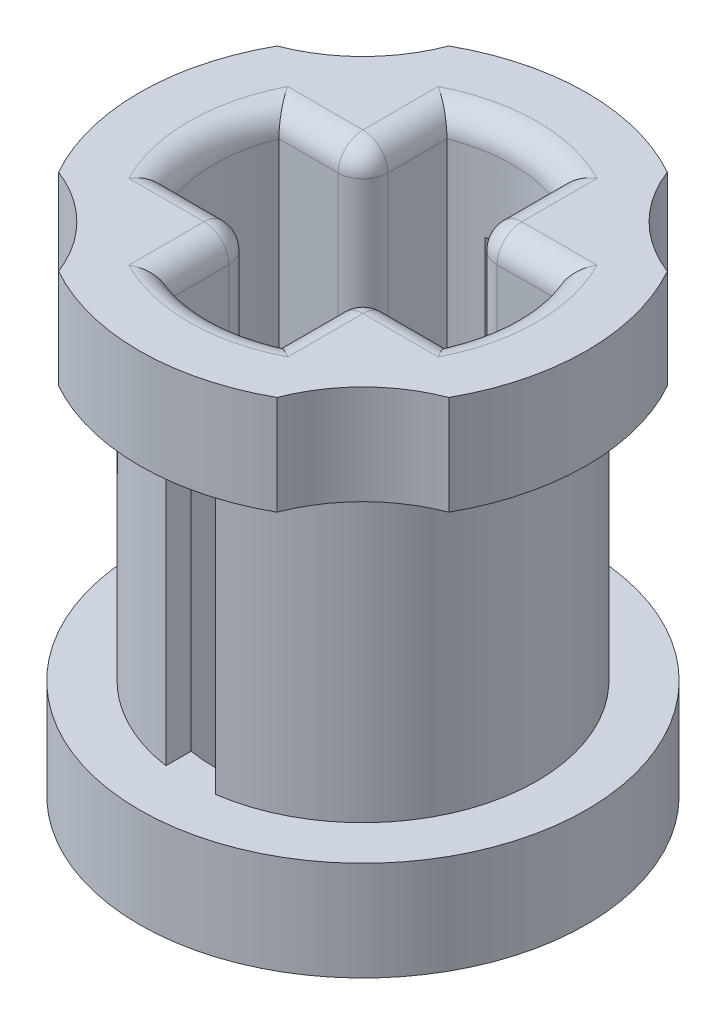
ISO-10303-21;
HEADER;
FILE_DESCRIPTION(('STEP AP214'),'2;1');
FILE_NAME('part.step','',(''),(''),'','','');
FILE_SCHEMA(('AUTOMOTIVE_DESIGN { 1 0 10303 214 1 1 1 1 }'));
ENDSEC;
DATA;
#1=APPLICATION_CONTEXT('core data for automotive mechanical design processes');
#2=APPLICATION_PROTOCOL_DEFINITION('international standard','automotive_design',2000,#1);
#3=PRODUCT_CONTEXT('',#1,'mechanical');
#4=PRODUCT('Part','Part','',(#3));
#5=PRODUCT_RELATED_PRODUCT_CATEGORY('part','',(#4));
#6=PRODUCT_DEFINITION_FORMATION('','',#4);
#7=PRODUCT_DEFINITION_CONTEXT('part definition',#1,'design');
#8=PRODUCT_DEFINITION('design','',#6,#7);
#9=PRODUCT_DEFINITION_SHAPE('','',#8);
#10=(LENGTH_UNIT() NAMED_UNIT(*) SI_UNIT(.MILLI.,.METRE.));
#11=(NAMED_UNIT(*) PLANE_ANGLE_UNIT() SI_UNIT($,.RADIAN.));
#12=(NAMED_UNIT(*) SI_UNIT($,.STERADIAN.) SOLID_ANGLE_UNIT());
#13=UNCERTAINTY_MEASURE_WITH_UNIT(LENGTH_MEASURE(1.E-05),#10,'distance_accuracy_value','');
#14=(GEOMETRIC_REPRESENTATION_CONTEXT(3) GLOBAL_UNCERTAINTY_ASSIGNED_CONTEXT((#13)) GLOBAL_UNIT_ASSIGNED_CONTEXT((#10,
#11,#12)) REPRESENTATION_CONTEXT('',''));
#15=CARTESIAN_POINT('',(0.,0.,0.));
#16=DIRECTION('',(0.,0.,1.));
#17=DIRECTION('',(1.,0.,0.));
#18=AXIS2_PLACEMENT_3D('',#15,#16,#17);
#19=CARTESIAN_POINT('',(0.,-4.,0.));
#20=DIRECTION('',(0.,1.,0.));
#21=DIRECTION('',(0.,0.,1.));
#22=AXIS2_PLACEMENT_3D('',#19,#20,#21);
#23=CYLINDRICAL_SURFACE('',#22,3.6);
#24=DIRECTION('',(0.,1.,0.));
#25=VECTOR('',#24,1.);
#26=CARTESIAN_POINT('',(-1.75898625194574,0.445517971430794,3.14101374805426));
#27=LINE('',#26,#25);
#28=CARTESIAN_POINT('',(-1.75898625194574,2.4,3.14101374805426));
#29=VERTEX_POINT('',#28);
#30=CARTESIAN_POINT('',(-1.75898625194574,4.,3.14101374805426));
#31=VERTEX_POINT('',#30);
#32=EDGE_CURVE('E881',#29,#31,#27,.T.);
#33=ORIENTED_EDGE('',*,*,#32,.F.);
#34=CARTESIAN_POINT('',(0.,2.4,0.));
#35=DIRECTION('',(0.,1.,0.));
#36=DIRECTION('',(0.,0.,1.));
#37=AXIS2_PLACEMENT_3D('',#34,#35,#36);
#38=CIRCLE('',#37,3.6);
#39=CARTESIAN_POINT('',(1.75898625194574,2.4,3.14101374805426));
#40=VERTEX_POINT('',#39);
#41=EDGE_CURVE('E795',#29,#40,#38,.T.);
#42=ORIENTED_EDGE('',*,*,#41,.T.);
#43=DIRECTION('',(0.,1.,0.));
#44=VECTOR('',#43,1.);
#45=CARTESIAN_POINT('',(1.75898625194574,0.445517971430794,3.14101374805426));
#46=LINE('',#45,#44);
#47=CARTESIAN_POINT('',(1.75898625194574,4.,3.14101374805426));
#48=VERTEX_POINT('',#47);
#49=EDGE_CURVE('E862',#40,#48,#46,.T.);
#50=ORIENTED_EDGE('',*,*,#49,.T.);
#51=CARTESIAN_POINT('',(0.,4.,0.));
#52=DIRECTION('',(0.,1.,0.));
#53=DIRECTION('',(0.,0.,1.));
#54=AXIS2_PLACEMENT_3D('',#51,#52,#53);
#55=CIRCLE('',#54,3.6);
#56=EDGE_CURVE('E342',#31,#48,#55,.T.);
#57=ORIENTED_EDGE('',*,*,#56,.F.);
#58=EDGE_LOOP('',(#33,#42,#50,#57));
#59=FACE_BOUND('',#58,.T.);
#60=ADVANCED_FACE('F34',(#59),#23,.T.);
#61=DIRECTION('',(0.,1.,0.));
#62=VECTOR('',#61,1.);
#63=CARTESIAN_POINT('',(1.75898625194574,0.445517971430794,-3.14101374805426));
#64=LINE('',#63,#62);
#65=CARTESIAN_POINT('',(1.75898625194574,2.4,-3.14101374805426));
#66=VERTEX_POINT('',#65);
#67=CARTESIAN_POINT('',(1.75898625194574,4.,-3.14101374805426));
#68=VERTEX_POINT('',#67);
#69=EDGE_CURVE('E874',#66,#68,#64,.T.);
#70=ORIENTED_EDGE('',*,*,#69,.F.);
#71=CARTESIAN_POINT('',(-1.75898625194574,2.4,-3.14101374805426));
#72=VERTEX_POINT('',#71);
#73=EDGE_CURVE('E891',#66,#72,#38,.T.);
#74=ORIENTED_EDGE('',*,*,#73,.T.);
#75=DIRECTION('',(0.,1.,0.));
#76=VECTOR('',#75,1.);
#77=CARTESIAN_POINT('',(-1.75898625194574,0.445517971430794,-3.14101374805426));
#78=LINE('',#77,#76);
#79=CARTESIAN_POINT('',(-1.75898625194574,4.,-3.14101374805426));
#80=VERTEX_POINT('',#79);
#81=EDGE_CURVE('E65',#72,#80,#78,.T.);
#82=ORIENTED_EDGE('',*,*,#81,.T.);
#83=EDGE_CURVE('E339',#68,#80,#55,.T.);
#84=ORIENTED_EDGE('',*,*,#83,.F.);
#85=EDGE_LOOP('',(#70,#74,#82,#84));
#86=FACE_BOUND('',#85,.T.);
#87=ADVANCED_FACE('F889',(#86),#23,.T.);
#88=DIRECTION('',(0.,1.,0.));
#89=VECTOR('',#88,1.);
#90=CARTESIAN_POINT('',(-3.14101374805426,0.445517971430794,1.75898625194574));
#91=LINE('',#90,#89);
#92=CARTESIAN_POINT('',(-3.14101374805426,2.4,1.75898625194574));
#93=VERTEX_POINT('',#92);
#94=CARTESIAN_POINT('',(-3.14101374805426,4.,1.75898625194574));
#95=VERTEX_POINT('',#94);
#96=EDGE_CURVE('E57',#93,#95,#91,.T.);
#97=ORIENTED_EDGE('',*,*,#96,.T.);
#98=CARTESIAN_POINT('',(-3.14101374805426,4.,-1.75898625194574));
#99=VERTEX_POINT('',#98);
#100=EDGE_CURVE('E336',#99,#95,#55,.T.);
#101=ORIENTED_EDGE('',*,*,#100,.F.);
#102=DIRECTION('',(0.,1.,0.));
#103=VECTOR('',#102,1.);
#104=CARTESIAN_POINT('',(-3.14101374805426,0.445517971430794,-1.75898625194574));
#105=LINE('',#104,#103);
#106=CARTESIAN_POINT('',(-3.14101374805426,2.4,-1.75898625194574));
#107=VERTEX_POINT('',#106);
#108=EDGE_CURVE('E320',#107,#99,#105,.T.);
#109=ORIENTED_EDGE('',*,*,#108,.F.);
#110=EDGE_CURVE('E798',#107,#93,#38,.T.);
#111=ORIENTED_EDGE('',*,*,#110,.T.);
#112=EDGE_LOOP('',(#97,#101,#109,#111));
#113=FACE_BOUND('',#112,.T.);
#114=ADVANCED_FACE('F341',(#113),#23,.T.);
#115=CARTESIAN_POINT('',(0.,2.4,0.));
#116=DIRECTION('',(0.,-1.,0.));
#117=DIRECTION('',(0.,0.,-1.));
#118=AXIS2_PLACEMENT_3D('',#115,#116,#117);
#119=CYLINDRICAL_SURFACE('',#118,2.8);
#120=CARTESIAN_POINT('',(0.,2.4,0.));
#121=DIRECTION('',(0.,1.,0.));
#122=DIRECTION('',(0.,0.,1.));
#123=AXIS2_PLACEMENT_3D('',#120,#121,#122);
#124=CIRCLE('',#123,2.8);
#125=CARTESIAN_POINT('',(0.4,2.4,2.7712812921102));
#126=VERTEX_POINT('',#125);
#127=CARTESIAN_POINT('',(0.4,2.4,-2.7712812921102));
#128=VERTEX_POINT('',#127);
#129=EDGE_CURVE('E799',#126,#128,#124,.T.);
#130=ORIENTED_EDGE('',*,*,#129,.F.);
#131=DIRECTION('',(0.,-1.,0.));
#132=VECTOR('',#131,1.);
#133=CARTESIAN_POINT('',(0.4,2.4,2.7712812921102));
#134=LINE('',#133,#132);
#135=CARTESIAN_POINT('',(0.4,-2.4,2.7712812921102));
#136=VERTEX_POINT('',#135);
#137=EDGE_CURVE('E828',#126,#136,#134,.T.);
#138=ORIENTED_EDGE('',*,*,#137,.T.);
#139=CARTESIAN_POINT('',(0.,-2.4,0.));
#140=DIRECTION('',(0.,1.,0.));
#141=DIRECTION('',(0.,0.,1.));
#142=AXIS2_PLACEMENT_3D('',#139,#140,#141);
#143=CIRCLE('',#142,2.8);
#144=CARTESIAN_POINT('',(0.4,-2.4,-2.7712812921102));
#145=VERTEX_POINT('',#144);
#146=EDGE_CURVE('E806',#136,#145,#143,.T.);
#147=ORIENTED_EDGE('',*,*,#146,.T.);
#148=DIRECTION('',(0.,-1.,0.));
#149=VECTOR('',#148,1.);
#150=CARTESIAN_POINT('',(0.4,2.4,-2.7712812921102));
#151=LINE('',#150,#149);
#152=EDGE_CURVE('E831',#145,#128,#151,.F.);
#153=ORIENTED_EDGE('',*,*,#152,.T.);
#154=EDGE_LOOP('',(#130,#138,#147,#153));
#155=FACE_BOUND('',#154,.T.);
#156=ADVANCED_FACE('F939',(#155),#119,.T.);
#157=CARTESIAN_POINT('',(0.,-4.,0.));
#158=DIRECTION('',(0.,1.,0.));
#159=DIRECTION('',(0.,0.,1.));
#160=AXIS2_PLACEMENT_3D('',#157,#158,#159);
#161=CIRCLE('',#160,3.6);
#162=CARTESIAN_POINT('',(0.,-4.,3.6));
#163=VERTEX_POINT('',#162);
#164=EDGE_CURVE('E351',#163,#163,#161,.T.);
#165=ORIENTED_EDGE('',*,*,#164,.T.);
#166=EDGE_LOOP('',(#165));
#167=FACE_BOUND('',#166,.T.);
#168=CARTESIAN_POINT('',(0.,-2.4,0.));
#169=DIRECTION('',(0.,1.,0.));
#170=DIRECTION('',(0.,0.,1.));
#171=AXIS2_PLACEMENT_3D('',#168,#169,#170);
#172=CIRCLE('',#171,3.6);
#173=CARTESIAN_POINT('',(0.,-2.4,3.6));
#174=VERTEX_POINT('',#173);
#175=EDGE_CURVE('E803',#174,#174,#172,.T.);
#176=ORIENTED_EDGE('',*,*,#175,.F.);
#177=EDGE_LOOP('',(#176));
#178=FACE_BOUND('',#177,.T.);
#179=ADVANCED_FACE('F933',(#167,#178),#23,.T.);
#180=DIRECTION('',(0.,1.,0.));
#181=VECTOR('',#180,1.);
#182=CARTESIAN_POINT('',(3.14101374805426,0.445517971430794,-1.75898625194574));
#183=LINE('',#182,#181);
#184=CARTESIAN_POINT('',(3.14101374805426,2.4,-1.75898625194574));
#185=VERTEX_POINT('',#184);
#186=CARTESIAN_POINT('',(3.14101374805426,4.,-1.75898625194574));
#187=VERTEX_POINT('',#186);
#188=EDGE_CURVE('E873',#185,#187,#183,.T.);
#189=ORIENTED_EDGE('',*,*,#188,.T.);
#190=CARTESIAN_POINT('',(3.14101374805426,4.,1.75898625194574));
#191=VERTEX_POINT('',#190);
#192=EDGE_CURVE('E344',#191,#187,#55,.T.);
#193=ORIENTED_EDGE('',*,*,#192,.F.);
#194=DIRECTION('',(0.,1.,0.));
#195=VECTOR('',#194,1.);
#196=CARTESIAN_POINT('',(3.14101374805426,0.445517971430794,1.75898625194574));
#197=LINE('',#196,#195);
#198=CARTESIAN_POINT('',(3.14101374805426,2.4,1.75898625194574));
#199=VERTEX_POINT('',#198);
#200=EDGE_CURVE('E863',#199,#191,#197,.T.);
#201=ORIENTED_EDGE('',*,*,#200,.F.);
#202=EDGE_CURVE('E629',#199,#185,#38,.T.);
#203=ORIENTED_EDGE('',*,*,#202,.T.);
#204=EDGE_LOOP('',(#189,#193,#201,#203));
#205=FACE_BOUND('',#204,.T.);
#206=ADVANCED_FACE('F907',(#205),#23,.T.);
#207=CARTESIAN_POINT('',(0.,-4.,0.));
#208=DIRECTION('',(0.,1.,0.));
#209=DIRECTION('',(0.,0.,1.));
#210=AXIS2_PLACEMENT_3D('',#207,#208,#209);
#211=PLANE('',#210);
#212=DIRECTION('',(0.,0.,1.));
#213=VECTOR('',#212,1.);
#214=CARTESIAN_POINT('',(-1.28,-4.,0.));
#215=LINE('',#214,#213);
#216=CARTESIAN_POINT('',(-1.28,-4.,1.28));
#217=VERTEX_POINT('',#216);
#218=CARTESIAN_POINT('',(-1.28,-4.,2.49030118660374));
#219=VERTEX_POINT('',#218);
#220=EDGE_CURVE('E586',#217,#219,#215,.T.);
#221=ORIENTED_EDGE('',*,*,#220,.T.);
#222=CARTESIAN_POINT('',(0.,-4.,0.));
#223=DIRECTION('',(0.,1.,0.));
#224=DIRECTION('',(0.,0.,1.));
#225=AXIS2_PLACEMENT_3D('',#222,#223,#224);
#226=CIRCLE('',#225,2.8);
#227=CARTESIAN_POINT('',(1.28,-4.,2.49030118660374));
#228=VERTEX_POINT('',#227);
#229=EDGE_CURVE('E588',#219,#228,#226,.T.);
#230=ORIENTED_EDGE('',*,*,#229,.T.);
#231=DIRECTION('',(0.,0.,-1.));
#232=VECTOR('',#231,1.);
#233=CARTESIAN_POINT('',(1.28,-4.,0.));
#234=LINE('',#233,#232);
#235=CARTESIAN_POINT('',(1.28,-4.,1.28));
#236=VERTEX_POINT('',#235);
#237=EDGE_CURVE('E572',#228,#236,#234,.T.);
#238=ORIENTED_EDGE('',*,*,#237,.T.);
#239=DIRECTION('',(1.,0.,0.));
#240=VECTOR('',#239,1.);
#241=CARTESIAN_POINT('',(0.,-4.,1.28));
#242=LINE('',#241,#240);
#243=CARTESIAN_POINT('',(2.49030118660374,-4.,1.28));
#244=VERTEX_POINT('',#243);
#245=EDGE_CURVE('E569',#236,#244,#242,.T.);
#246=ORIENTED_EDGE('',*,*,#245,.T.);
#247=CARTESIAN_POINT('',(0.,-4.,0.));
#248=DIRECTION('',(0.,1.,0.));
#249=DIRECTION('',(0.,0.,1.));
#250=AXIS2_PLACEMENT_3D('',#247,#248,#249);
#251=CIRCLE('',#250,2.8);
#252=CARTESIAN_POINT('',(2.49030118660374,-4.,-1.28));
#253=VERTEX_POINT('',#252);
#254=EDGE_CURVE('E427',#244,#253,#251,.T.);
#255=ORIENTED_EDGE('',*,*,#254,.T.);
#256=DIRECTION('',(-1.,0.,0.));
#257=VECTOR('',#256,1.);
#258=CARTESIAN_POINT('',(0.,-4.,-1.28));
#259=LINE('',#258,#257);
#260=CARTESIAN_POINT('',(1.28,-4.,-1.28));
#261=VERTEX_POINT('',#260);
#262=EDGE_CURVE('E567',#253,#261,#259,.T.);
#263=ORIENTED_EDGE('',*,*,#262,.T.);
#264=DIRECTION('',(0.,0.,-1.));
#265=VECTOR('',#264,1.);
#266=CARTESIAN_POINT('',(1.28,-4.,0.));
#267=LINE('',#266,#265);
#268=CARTESIAN_POINT('',(1.28,-4.,-2.49030118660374));
#269=VERTEX_POINT('',#268);
#270=EDGE_CURVE('E574',#261,#269,#267,.T.);
#271=ORIENTED_EDGE('',*,*,#270,.T.);
#272=CARTESIAN_POINT('',(0.,-4.,0.));
#273=DIRECTION('',(0.,1.,0.));
#274=DIRECTION('',(0.,0.,1.));
#275=AXIS2_PLACEMENT_3D('',#272,#273,#274);
#276=CIRCLE('',#275,2.8);
#277=CARTESIAN_POINT('',(-1.28,-4.,-2.49030118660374));
#278=VERTEX_POINT('',#277);
#279=EDGE_CURVE('E576',#269,#278,#276,.T.);
#280=ORIENTED_EDGE('',*,*,#279,.T.);
#281=DIRECTION('',(0.,0.,1.));
#282=VECTOR('',#281,1.);
#283=CARTESIAN_POINT('',(-1.28,-4.,0.));
#284=LINE('',#283,#282);
#285=CARTESIAN_POINT('',(-1.28,-4.,-1.28));
#286=VERTEX_POINT('',#285);
#287=EDGE_CURVE('E578',#278,#286,#284,.T.);
#288=ORIENTED_EDGE('',*,*,#287,.T.);
#289=DIRECTION('',(-1.,0.,0.));
#290=VECTOR('',#289,1.);
#291=CARTESIAN_POINT('',(0.,-4.,-1.28));
#292=LINE('',#291,#290);
#293=CARTESIAN_POINT('',(-2.49030118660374,-4.,-1.28));
#294=VERTEX_POINT('',#293);
#295=EDGE_CURVE('E580',#286,#294,#292,.T.);
#296=ORIENTED_EDGE('',*,*,#295,.T.);
#297=CARTESIAN_POINT('',(0.,-4.,0.));
#298=DIRECTION('',(0.,1.,0.));
#299=DIRECTION('',(0.,0.,1.));
#300=AXIS2_PLACEMENT_3D('',#297,#298,#299);
#301=CIRCLE('',#300,2.8);
#302=CARTESIAN_POINT('',(-2.49030118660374,-4.,1.28));
#303=VERTEX_POINT('',#302);
#304=EDGE_CURVE('E582',#294,#303,#301,.T.);
#305=ORIENTED_EDGE('',*,*,#304,.T.);
#306=DIRECTION('',(1.,0.,0.));
#307=VECTOR('',#306,1.);
#308=CARTESIAN_POINT('',(0.,-4.,1.28));
#309=LINE('',#308,#307);
#310=EDGE_CURVE('E584',#303,#217,#309,.T.);
#311=ORIENTED_EDGE('',*,*,#310,.T.);
#312=EDGE_LOOP('',(#221,#230,#238,#246,#255,#263,#271,#280,#288,#296,#305,#311));
#313=FACE_BOUND('',#312,.T.);
#314=ORIENTED_EDGE('',*,*,#164,.F.);
#315=EDGE_LOOP('',(#314));
#316=FACE_BOUND('',#315,.T.);
#317=ADVANCED_FACE('F932',(#313,#316),#211,.F.);
#318=CARTESIAN_POINT('',(0.,4.,0.));
#319=DIRECTION('',(0.,1.,0.));
#320=DIRECTION('',(0.,0.,1.));
#321=AXIS2_PLACEMENT_3D('',#318,#319,#320);
#322=PLANE('',#321);
#323=CARTESIAN_POINT('',(-4.,4.,4.));
#324=DIRECTION('',(0.,1.,0.));
#325=DIRECTION('',(0.,0.,1.));
#326=AXIS2_PLACEMENT_3D('',#323,#324,#325);
#327=CIRCLE('',#326,2.4);
#328=EDGE_CURVE('E872',#31,#95,#327,.T.);
#329=ORIENTED_EDGE('',*,*,#328,.F.);
#330=ORIENTED_EDGE('',*,*,#56,.T.);
#331=CARTESIAN_POINT('',(4.,4.,4.));
#332=DIRECTION('',(0.,1.,0.));
#333=DIRECTION('',(0.,0.,1.));
#334=AXIS2_PLACEMENT_3D('',#331,#332,#333);
#335=CIRCLE('',#334,2.4);
#336=EDGE_CURVE('E865',#191,#48,#335,.T.);
#337=ORIENTED_EDGE('',*,*,#336,.F.);
#338=ORIENTED_EDGE('',*,*,#192,.T.);
#339=CARTESIAN_POINT('',(4.,4.,-4.));
#340=DIRECTION('',(0.,1.,0.));
#341=DIRECTION('',(0.,0.,1.));
#342=AXIS2_PLACEMENT_3D('',#339,#340,#341);
#343=CIRCLE('',#342,2.4);
#344=EDGE_CURVE('E876',#68,#187,#343,.T.);
#345=ORIENTED_EDGE('',*,*,#344,.F.);
#346=ORIENTED_EDGE('',*,*,#83,.T.);
#347=CARTESIAN_POINT('',(-4.,4.,-4.));
#348=DIRECTION('',(0.,1.,0.));
#349=DIRECTION('',(0.,0.,1.));
#350=AXIS2_PLACEMENT_3D('',#347,#348,#349);
#351=CIRCLE('',#350,2.4);
#352=EDGE_CURVE('E323',#99,#80,#351,.T.);
#353=ORIENTED_EDGE('',*,*,#352,.F.);
#354=ORIENTED_EDGE('',*,*,#100,.T.);
#355=EDGE_LOOP('',(#329,#330,#337,#338,#345,#346,#353,#354));
#356=FACE_BOUND('',#355,.T.);
#357=DIRECTION('',(1.,0.,0.));
#358=VECTOR('',#357,1.);
#359=CARTESIAN_POINT('',(1.28,4.,1.28));
#360=LINE('',#359,#358);
#361=CARTESIAN_POINT('',(2.49030118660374,4.,1.28));
#362=VERTEX_POINT('',#361);
#363=CARTESIAN_POINT('',(1.28,4.,1.28));
#364=VERTEX_POINT('',#363);
#365=EDGE_CURVE('E378',#362,#364,#360,.F.);
#366=ORIENTED_EDGE('',*,*,#365,.T.);
#367=DIRECTION('',(0.,0.,-1.));
#368=VECTOR('',#367,1.);
#369=CARTESIAN_POINT('',(1.28,4.,2.23284571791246));
#370=LINE('',#369,#368);
#371=CARTESIAN_POINT('',(1.28,4.,2.49030118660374));
#372=VERTEX_POINT('',#371);
#373=EDGE_CURVE('E380',#364,#372,#370,.F.);
#374=ORIENTED_EDGE('',*,*,#373,.T.);
#375=CARTESIAN_POINT('',(0.,4.,0.));
#376=DIRECTION('',(0.,1.,0.));
#377=DIRECTION('',(0.,0.,1.));
#378=AXIS2_PLACEMENT_3D('',#375,#376,#377);
#379=CIRCLE('',#378,2.8);
#380=CARTESIAN_POINT('',(-1.28,4.,2.49030118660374));
#381=VERTEX_POINT('',#380);
#382=EDGE_CURVE('E376',#372,#381,#379,.F.);
#383=ORIENTED_EDGE('',*,*,#382,.T.);
#384=DIRECTION('',(0.,0.,1.));
#385=VECTOR('',#384,1.);
#386=CARTESIAN_POINT('',(-1.28,4.,1.28));
#387=LINE('',#386,#385);
#388=CARTESIAN_POINT('',(-1.28,4.,1.28));
#389=VERTEX_POINT('',#388);
#390=EDGE_CURVE('E372',#381,#389,#387,.F.);
#391=ORIENTED_EDGE('',*,*,#390,.T.);
#392=DIRECTION('',(1.,0.,0.));
#393=VECTOR('',#392,1.);
#394=CARTESIAN_POINT('',(-2.23284571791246,4.,1.28));
#395=LINE('',#394,#393);
#396=CARTESIAN_POINT('',(-2.49030118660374,4.,1.28));
#397=VERTEX_POINT('',#396);
#398=EDGE_CURVE('E363',#389,#397,#395,.F.);
#399=ORIENTED_EDGE('',*,*,#398,.T.);
#400=CARTESIAN_POINT('',(0.,4.,0.));
#401=DIRECTION('',(0.,1.,0.));
#402=DIRECTION('',(0.,0.,1.));
#403=AXIS2_PLACEMENT_3D('',#400,#401,#402);
#404=CIRCLE('',#403,2.8);
#405=CARTESIAN_POINT('',(-2.49030118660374,4.,-1.28));
#406=VERTEX_POINT('',#405);
#407=EDGE_CURVE('E359',#397,#406,#404,.F.);
#408=ORIENTED_EDGE('',*,*,#407,.T.);
#409=DIRECTION('',(-1.,0.,0.));
#410=VECTOR('',#409,1.);
#411=CARTESIAN_POINT('',(-1.28,4.,-1.28));
#412=LINE('',#411,#410);
#413=CARTESIAN_POINT('',(-1.28,4.,-1.28));
#414=VERTEX_POINT('',#413);
#415=EDGE_CURVE('E357',#406,#414,#412,.F.);
#416=ORIENTED_EDGE('',*,*,#415,.T.);
#417=DIRECTION('',(0.,0.,1.));
#418=VECTOR('',#417,1.);
#419=CARTESIAN_POINT('',(-1.28,4.,-2.23284571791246));
#420=LINE('',#419,#418);
#421=CARTESIAN_POINT('',(-1.28,4.,-2.49030118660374));
#422=VERTEX_POINT('',#421);
#423=EDGE_CURVE('E361',#414,#422,#420,.F.);
#424=ORIENTED_EDGE('',*,*,#423,.T.);
#425=CARTESIAN_POINT('',(0.,4.,0.));
#426=DIRECTION('',(0.,1.,0.));
#427=DIRECTION('',(0.,0.,1.));
#428=AXIS2_PLACEMENT_3D('',#425,#426,#427);
#429=CIRCLE('',#428,2.8);
#430=CARTESIAN_POINT('',(1.28,4.,-2.49030118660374));
#431=VERTEX_POINT('',#430);
#432=EDGE_CURVE('E366',#422,#431,#429,.F.);
#433=ORIENTED_EDGE('',*,*,#432,.T.);
#434=DIRECTION('',(0.,0.,-1.));
#435=VECTOR('',#434,1.);
#436=CARTESIAN_POINT('',(1.28,4.,-1.28));
#437=LINE('',#436,#435);
#438=CARTESIAN_POINT('',(1.28,4.,-1.28));
#439=VERTEX_POINT('',#438);
#440=EDGE_CURVE('E368',#431,#439,#437,.F.);
#441=ORIENTED_EDGE('',*,*,#440,.T.);
#442=DIRECTION('',(-1.,0.,0.));
#443=VECTOR('',#442,1.);
#444=CARTESIAN_POINT('',(2.23284571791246,4.,-1.28));
#445=LINE('',#444,#443);
#446=CARTESIAN_POINT('',(2.49030118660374,4.,-1.28));
#447=VERTEX_POINT('',#446);
#448=EDGE_CURVE('E370',#439,#447,#445,.F.);
#449=ORIENTED_EDGE('',*,*,#448,.T.);
#450=CARTESIAN_POINT('',(0.,4.,0.));
#451=DIRECTION('',(0.,1.,0.));
#452=DIRECTION('',(0.,0.,1.));
#453=AXIS2_PLACEMENT_3D('',#450,#451,#452);
#454=CIRCLE('',#453,2.8);
#455=EDGE_CURVE('E374',#447,#362,#454,.F.);
#456=ORIENTED_EDGE('',*,*,#455,.T.);
#457=EDGE_LOOP('',(#366,#374,#383,#391,#399,#408,#416,#424,#433,#441,#449,#456));
#458=FACE_BOUND('',#457,.T.);
#459=ADVANCED_FACE('F334',(#356,#458),#322,.T.);
#460=CARTESIAN_POINT('',(0.,-4.,0.));
#461=DIRECTION('',(0.,1.,0.));
#462=DIRECTION('',(0.,0.,1.));
#463=AXIS2_PLACEMENT_3D('',#460,#461,#462);
#464=CYLINDRICAL_SURFACE('',#463,2.4);
#465=DIRECTION('',(0.,1.,0.));
#466=VECTOR('',#465,1.);
#467=CARTESIAN_POINT('',(-0.399999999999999,-4.,-2.36643191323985));
#468=LINE('',#467,#466);
#469=CARTESIAN_POINT('',(-0.399999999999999,-2.4,-2.36643191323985));
#470=VERTEX_POINT('',#469);
#471=CARTESIAN_POINT('',(-0.399999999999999,2.4,-2.36643191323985));
#472=VERTEX_POINT('',#471);
#473=EDGE_CURVE('E834',#470,#472,#468,.T.);
#474=ORIENTED_EDGE('',*,*,#473,.T.);
#475=CARTESIAN_POINT('',(0.,2.4,0.));
#476=DIRECTION('',(0.,1.,0.));
#477=DIRECTION('',(0.,0.,1.));
#478=AXIS2_PLACEMENT_3D('',#475,#476,#477);
#479=CIRCLE('',#478,2.4);
#480=CARTESIAN_POINT('',(0.4,2.4,-2.36643191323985));
#481=VERTEX_POINT('',#480);
#482=EDGE_CURVE('E810',#472,#481,#479,.F.);
#483=ORIENTED_EDGE('',*,*,#482,.T.);
#484=DIRECTION('',(0.,1.,0.));
#485=VECTOR('',#484,1.);
#486=CARTESIAN_POINT('',(0.4,-4.,-2.36643191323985));
#487=LINE('',#486,#485);
#488=CARTESIAN_POINT('',(0.4,-2.4,-2.36643191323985));
#489=VERTEX_POINT('',#488);
#490=EDGE_CURVE('E822',#481,#489,#487,.F.);
#491=ORIENTED_EDGE('',*,*,#490,.T.);
#492=CARTESIAN_POINT('',(0.,-2.4,0.));
#493=DIRECTION('',(0.,-1.,0.));
#494=DIRECTION('',(1.,0.,0.));
#495=AXIS2_PLACEMENT_3D('',#492,#493,#494);
#496=CIRCLE('',#495,2.4);
#497=EDGE_CURVE('E816',#489,#470,#496,.F.);
#498=ORIENTED_EDGE('',*,*,#497,.T.);
#499=EDGE_LOOP('',(#474,#483,#491,#498));
#500=FACE_BOUND('',#499,.T.);
#501=DIRECTION('',(0.,1.,0.));
#502=VECTOR('',#501,1.);
#503=CARTESIAN_POINT('',(-0.88,-4.,-2.23284571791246));
#504=LINE('',#503,#502);
#505=CARTESIAN_POINT('',(-0.88,-3.6,-2.23284571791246));
#506=VERTEX_POINT('',#505);
#507=CARTESIAN_POINT('',(-0.88,3.6,-2.23284571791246));
#508=VERTEX_POINT('',#507);
#509=EDGE_CURVE('E349',#506,#508,#504,.T.);
#510=ORIENTED_EDGE('',*,*,#509,.F.);
#511=CARTESIAN_POINT('',(0.,-3.6,0.));
#512=DIRECTION('',(0.,1.,0.));
#513=DIRECTION('',(0.,0.,1.));
#514=AXIS2_PLACEMENT_3D('',#511,#512,#513);
#515=CIRCLE('',#514,2.4);
#516=CARTESIAN_POINT('',(0.88,-3.6,-2.23284571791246));
#517=VERTEX_POINT('',#516);
#518=EDGE_CURVE('E617',#506,#517,#515,.F.);
#519=ORIENTED_EDGE('',*,*,#518,.T.);
#520=DIRECTION('',(0.,1.,0.));
#521=VECTOR('',#520,1.);
#522=CARTESIAN_POINT('',(0.88,-4.,-2.23284571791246));
#523=LINE('',#522,#521);
#524=CARTESIAN_POINT('',(0.88,3.6,-2.23284571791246));
#525=VERTEX_POINT('',#524);
#526=EDGE_CURVE('E346',#517,#525,#523,.T.);
#527=ORIENTED_EDGE('',*,*,#526,.T.);
#528=CARTESIAN_POINT('',(0.,3.6,0.));
#529=DIRECTION('',(0.,1.,0.));
#530=DIRECTION('',(0.,0.,1.));
#531=AXIS2_PLACEMENT_3D('',#528,#529,#530);
#532=CIRCLE('',#531,2.4);
#533=EDGE_CURVE('E421',#525,#508,#532,.T.);
#534=ORIENTED_EDGE('',*,*,#533,.T.);
#535=EDGE_LOOP('',(#510,#519,#527,#534));
#536=FACE_BOUND('',#535,.T.);
#537=ADVANCED_FACE('F973',(#500,#536),#464,.F.);
#538=CARTESIAN_POINT('',(0.88,-4.,-2.23284571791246));
#539=DIRECTION('',(1.,0.,0.));
#540=DIRECTION('',(0.,0.,-1.));
#541=AXIS2_PLACEMENT_3D('',#538,#539,#540);
#542=PLANE('',#541);
#543=ORIENTED_EDGE('',*,*,#526,.F.);
#544=DIRECTION('',(0.,0.,-1.));
#545=VECTOR('',#544,1.);
#546=CARTESIAN_POINT('',(0.88,-3.6,-2.23284571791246));
#547=LINE('',#546,#545);
#548=CARTESIAN_POINT('',(0.88,-3.6,-1.28));
#549=VERTEX_POINT('',#548);
#550=EDGE_CURVE('E601',#517,#549,#547,.F.);
#551=ORIENTED_EDGE('',*,*,#550,.T.);
#552=DIRECTION('',(0.,1.,0.));
#553=VECTOR('',#552,1.);
#554=CARTESIAN_POINT('',(0.88,-4.,-1.28));
#555=LINE('',#554,#553);
#556=CARTESIAN_POINT('',(0.88,3.6,-1.28));
#557=VERTEX_POINT('',#556);
#558=EDGE_CURVE('E792',#549,#557,#555,.T.);
#559=ORIENTED_EDGE('',*,*,#558,.T.);
#560=DIRECTION('',(0.,0.,-1.));
#561=VECTOR('',#560,1.);
#562=CARTESIAN_POINT('',(0.88,3.6,-2.23284571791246));
#563=LINE('',#562,#561);
#564=EDGE_CURVE('E418',#557,#525,#563,.T.);
#565=ORIENTED_EDGE('',*,*,#564,.T.);
#566=EDGE_LOOP('',(#543,#551,#559,#565));
#567=FACE_BOUND('',#566,.T.);
#568=ADVANCED_FACE('F978',(#567),#542,.F.);
#569=CARTESIAN_POINT('',(1.28,-4.,-1.28));
#570=DIRECTION('',(0.,1.,0.));
#571=DIRECTION('',(0.,0.,1.));
#572=AXIS2_PLACEMENT_3D('',#569,#570,#571);
#573=CYLINDRICAL_SURFACE('',#572,0.4);
#574=ORIENTED_EDGE('',*,*,#558,.F.);
#575=CARTESIAN_POINT('',(1.28,-3.6,-1.28));
#576=DIRECTION('',(0.,1.,0.));
#577=DIRECTION('',(0.,0.,1.));
#578=AXIS2_PLACEMENT_3D('',#575,#576,#577);
#579=CIRCLE('',#578,0.4);
#580=CARTESIAN_POINT('',(1.28,-3.6,-0.88));
#581=VERTEX_POINT('',#580);
#582=EDGE_CURVE('E49',#549,#581,#579,.T.);
#583=ORIENTED_EDGE('',*,*,#582,.T.);
#584=DIRECTION('',(0.,1.,0.));
#585=VECTOR('',#584,1.);
#586=CARTESIAN_POINT('',(1.28,-4.,-0.88));
#587=LINE('',#586,#585);
#588=CARTESIAN_POINT('',(1.28,3.6,-0.88));
#589=VERTEX_POINT('',#588);
#590=EDGE_CURVE('E790',#581,#589,#587,.T.);
#591=ORIENTED_EDGE('',*,*,#590,.T.);
#592=CARTESIAN_POINT('',(1.28,3.6,-1.28));
#593=DIRECTION('',(0.,1.,0.));
#594=DIRECTION('',(0.,0.,1.));
#595=AXIS2_PLACEMENT_3D('',#592,#593,#594);
#596=CIRCLE('',#595,0.4);
#597=EDGE_CURVE('E394',#589,#557,#596,.F.);
#598=ORIENTED_EDGE('',*,*,#597,.T.);
#599=EDGE_LOOP('',(#574,#583,#591,#598));
#600=FACE_BOUND('',#599,.T.);
#601=ADVANCED_FACE('F1118',(#600),#573,.T.);
#602=CARTESIAN_POINT('',(1.28,-4.,-0.88));
#603=DIRECTION('',(0.,0.,-1.));
#604=DIRECTION('',(-1.,0.,0.));
#605=AXIS2_PLACEMENT_3D('',#602,#603,#604);
#606=PLANE('',#605);
#607=ORIENTED_EDGE('',*,*,#590,.F.);
#608=DIRECTION('',(-1.,0.,0.));
#609=VECTOR('',#608,1.);
#610=CARTESIAN_POINT('',(1.28,-3.6,-0.88));
#611=LINE('',#610,#609);
#612=CARTESIAN_POINT('',(2.23284571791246,-3.6,-0.88));
#613=VERTEX_POINT('',#612);
#614=EDGE_CURVE('E599',#581,#613,#611,.F.);
#615=ORIENTED_EDGE('',*,*,#614,.T.);
#616=DIRECTION('',(0.,1.,0.));
#617=VECTOR('',#616,1.);
#618=CARTESIAN_POINT('',(2.23284571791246,-4.,-0.88));
#619=LINE('',#618,#617);
#620=CARTESIAN_POINT('',(2.23284571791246,3.6,-0.88));
#621=VERTEX_POINT('',#620);
#622=EDGE_CURVE('E788',#613,#621,#619,.T.);
#623=ORIENTED_EDGE('',*,*,#622,.T.);
#624=DIRECTION('',(-1.,0.,0.));
#625=VECTOR('',#624,1.);
#626=CARTESIAN_POINT('',(1.28,3.6,-0.88));
#627=LINE('',#626,#625);
#628=EDGE_CURVE('E391',#621,#589,#627,.T.);
#629=ORIENTED_EDGE('',*,*,#628,.T.);
#630=EDGE_LOOP('',(#607,#615,#623,#629));
#631=FACE_BOUND('',#630,.T.);
#632=ADVANCED_FACE('F1128',(#631),#606,.F.);
#633=CARTESIAN_POINT('',(0.,-4.,0.));
#634=DIRECTION('',(0.,1.,0.));
#635=DIRECTION('',(0.,0.,1.));
#636=AXIS2_PLACEMENT_3D('',#633,#634,#635);
#637=CYLINDRICAL_SURFACE('',#636,2.4);
#638=ORIENTED_EDGE('',*,*,#622,.F.);
#639=CARTESIAN_POINT('',(0.,-3.6,0.));
#640=DIRECTION('',(0.,1.,0.));
#641=DIRECTION('',(0.,0.,1.));
#642=AXIS2_PLACEMENT_3D('',#639,#640,#641);
#643=CIRCLE('',#642,2.4);
#644=CARTESIAN_POINT('',(2.23284571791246,-3.6,0.88));
#645=VERTEX_POINT('',#644);
#646=EDGE_CURVE('E11',#613,#645,#643,.F.);
#647=ORIENTED_EDGE('',*,*,#646,.T.);
#648=DIRECTION('',(0.,1.,0.));
#649=VECTOR('',#648,1.);
#650=CARTESIAN_POINT('',(2.23284571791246,-4.,0.88));
#651=LINE('',#650,#649);
#652=CARTESIAN_POINT('',(2.23284571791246,3.6,0.88));
#653=VERTEX_POINT('',#652);
#654=EDGE_CURVE('E786',#645,#653,#651,.T.);
#655=ORIENTED_EDGE('',*,*,#654,.T.);
#656=CARTESIAN_POINT('',(0.,3.6,0.));
#657=DIRECTION('',(0.,1.,0.));
#658=DIRECTION('',(0.,0.,1.));
#659=AXIS2_PLACEMENT_3D('',#656,#657,#658);
#660=CIRCLE('',#659,2.4);
#661=EDGE_CURVE('E406',#653,#621,#660,.T.);
#662=ORIENTED_EDGE('',*,*,#661,.T.);
#663=EDGE_LOOP('',(#638,#647,#655,#662));
#664=FACE_BOUND('',#663,.T.);
#665=ADVANCED_FACE('F1138',(#664),#637,.F.);
#666=CARTESIAN_POINT('',(1.28,-4.,0.88));
#667=DIRECTION('',(0.,0.,1.));
#668=DIRECTION('',(1.,0.,0.));
#669=AXIS2_PLACEMENT_3D('',#666,#667,#668);
#670=PLANE('',#669);
#671=ORIENTED_EDGE('',*,*,#654,.F.);
#672=DIRECTION('',(1.,0.,0.));
#673=VECTOR('',#672,1.);
#674=CARTESIAN_POINT('',(1.28,-3.6,0.88));
#675=LINE('',#674,#673);
#676=CARTESIAN_POINT('',(1.28,-3.6,0.88));
#677=VERTEX_POINT('',#676);
#678=EDGE_CURVE('E590',#645,#677,#675,.F.);
#679=ORIENTED_EDGE('',*,*,#678,.T.);
#680=DIRECTION('',(0.,1.,0.));
#681=VECTOR('',#680,1.);
#682=CARTESIAN_POINT('',(1.28,-4.,0.88));
#683=LINE('',#682,#681);
#684=CARTESIAN_POINT('',(1.28,3.6,0.88));
#685=VERTEX_POINT('',#684);
#686=EDGE_CURVE('E784',#677,#685,#683,.T.);
#687=ORIENTED_EDGE('',*,*,#686,.T.);
#688=DIRECTION('',(1.,0.,0.));
#689=VECTOR('',#688,1.);
#690=CARTESIAN_POINT('',(2.23284571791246,3.6,0.88));
#691=LINE('',#690,#689);
#692=EDGE_CURVE('E388',#685,#653,#691,.T.);
#693=ORIENTED_EDGE('',*,*,#692,.T.);
#694=EDGE_LOOP('',(#671,#679,#687,#693));
#695=FACE_BOUND('',#694,.T.);
#696=ADVANCED_FACE('F1148',(#695),#670,.F.);
#697=CARTESIAN_POINT('',(1.28,-4.,1.28));
#698=DIRECTION('',(0.,1.,0.));
#699=DIRECTION('',(0.,0.,1.));
#700=AXIS2_PLACEMENT_3D('',#697,#698,#699);
#701=CYLINDRICAL_SURFACE('',#700,0.4);
#702=ORIENTED_EDGE('',*,*,#686,.F.);
#703=CARTESIAN_POINT('',(1.28,-3.6,1.28));
#704=DIRECTION('',(0.,1.,0.));
#705=DIRECTION('',(0.,0.,1.));
#706=AXIS2_PLACEMENT_3D('',#703,#704,#705);
#707=CIRCLE('',#706,0.4);
#708=CARTESIAN_POINT('',(0.880000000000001,-3.6,1.28));
#709=VERTEX_POINT('',#708);
#710=EDGE_CURVE('E593',#677,#709,#707,.T.);
#711=ORIENTED_EDGE('',*,*,#710,.T.);
#712=DIRECTION('',(0.,1.,0.));
#713=VECTOR('',#712,1.);
#714=CARTESIAN_POINT('',(0.880000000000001,-4.,1.28));
#715=LINE('',#714,#713);
#716=CARTESIAN_POINT('',(0.880000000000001,3.6,1.28));
#717=VERTEX_POINT('',#716);
#718=EDGE_CURVE('E782',#709,#717,#715,.T.);
#719=ORIENTED_EDGE('',*,*,#718,.T.);
#720=CARTESIAN_POINT('',(1.28,3.6,1.28));
#721=DIRECTION('',(0.,1.,0.));
#722=DIRECTION('',(0.,0.,1.));
#723=AXIS2_PLACEMENT_3D('',#720,#721,#722);
#724=CIRCLE('',#723,0.4);
#725=EDGE_CURVE('E415',#717,#685,#724,.F.);
#726=ORIENTED_EDGE('',*,*,#725,.T.);
#727=EDGE_LOOP('',(#702,#711,#719,#726));
#728=FACE_BOUND('',#727,.T.);
#729=ADVANCED_FACE('F1158',(#728),#701,.T.);
#730=CARTESIAN_POINT('',(0.88,-4.,1.28));
#731=DIRECTION('',(1.,0.,0.));
#732=DIRECTION('',(0.,0.,-1.));
#733=AXIS2_PLACEMENT_3D('',#730,#731,#732);
#734=PLANE('',#733);
#735=ORIENTED_EDGE('',*,*,#718,.F.);
#736=DIRECTION('',(0.,0.,-1.));
#737=VECTOR('',#736,1.);
#738=CARTESIAN_POINT('',(0.88,-3.6,1.28));
#739=LINE('',#738,#737);
#740=CARTESIAN_POINT('',(0.880000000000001,-3.6,2.23284571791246));
#741=VERTEX_POINT('',#740);
#742=EDGE_CURVE('E603',#709,#741,#739,.F.);
#743=ORIENTED_EDGE('',*,*,#742,.T.);
#744=DIRECTION('',(0.,1.,0.));
#745=VECTOR('',#744,1.);
#746=CARTESIAN_POINT('',(0.880000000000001,-4.,2.23284571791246));
#747=LINE('',#746,#745);
#748=CARTESIAN_POINT('',(0.880000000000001,3.6,2.23284571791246));
#749=VERTEX_POINT('',#748);
#750=EDGE_CURVE('E780',#741,#749,#747,.T.);
#751=ORIENTED_EDGE('',*,*,#750,.T.);
#752=DIRECTION('',(0.,0.,-1.));
#753=VECTOR('',#752,1.);
#754=CARTESIAN_POINT('',(0.88,3.6,1.28));
#755=LINE('',#754,#753);
#756=EDGE_CURVE('E385',#749,#717,#755,.T.);
#757=ORIENTED_EDGE('',*,*,#756,.T.);
#758=EDGE_LOOP('',(#735,#743,#751,#757));
#759=FACE_BOUND('',#758,.T.);
#760=ADVANCED_FACE('F994',(#759),#734,.F.);
#761=CARTESIAN_POINT('',(0.,-4.,0.));
#762=DIRECTION('',(0.,1.,0.));
#763=DIRECTION('',(0.,0.,1.));
#764=AXIS2_PLACEMENT_3D('',#761,#762,#763);
#765=CYLINDRICAL_SURFACE('',#764,2.4);
#766=DIRECTION('',(0.,1.,0.));
#767=VECTOR('',#766,1.);
#768=CARTESIAN_POINT('',(0.4,-4.,2.36643191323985));
#769=LINE('',#768,#767);
#770=CARTESIAN_POINT('',(0.4,-2.4,2.36643191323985));
#771=VERTEX_POINT('',#770);
#772=CARTESIAN_POINT('',(0.4,2.4,2.36643191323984));
#773=VERTEX_POINT('',#772);
#774=EDGE_CURVE('E825',#771,#773,#769,.T.);
#775=ORIENTED_EDGE('',*,*,#774,.T.);
#776=CARTESIAN_POINT('',(0.,2.4,0.));
#777=DIRECTION('',(0.,1.,0.));
#778=DIRECTION('',(0.,0.,1.));
#779=AXIS2_PLACEMENT_3D('',#776,#777,#778);
#780=CIRCLE('',#779,2.4);
#781=CARTESIAN_POINT('',(-0.4,2.4,2.36643191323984));
#782=VERTEX_POINT('',#781);
#783=EDGE_CURVE('E813',#773,#782,#780,.F.);
#784=ORIENTED_EDGE('',*,*,#783,.T.);
#785=DIRECTION('',(0.,1.,0.));
#786=VECTOR('',#785,1.);
#787=CARTESIAN_POINT('',(-0.399999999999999,-4.,2.36643191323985));
#788=LINE('',#787,#786);
#789=CARTESIAN_POINT('',(-0.399999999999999,-2.4,2.36643191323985));
#790=VERTEX_POINT('',#789);
#791=EDGE_CURVE('E837',#782,#790,#788,.F.);
#792=ORIENTED_EDGE('',*,*,#791,.T.);
#793=CARTESIAN_POINT('',(0.,-2.4,0.));
#794=DIRECTION('',(0.,-1.,0.));
#795=DIRECTION('',(1.,0.,0.));
#796=AXIS2_PLACEMENT_3D('',#793,#794,#795);
#797=CIRCLE('',#796,2.4);
#798=EDGE_CURVE('E819',#790,#771,#797,.F.);
#799=ORIENTED_EDGE('',*,*,#798,.T.);
#800=EDGE_LOOP('',(#775,#784,#792,#799));
#801=FACE_BOUND('',#800,.T.);
#802=ORIENTED_EDGE('',*,*,#750,.F.);
#803=CARTESIAN_POINT('',(0.,-3.6,0.));
#804=DIRECTION('',(0.,1.,0.));
#805=DIRECTION('',(0.,0.,1.));
#806=AXIS2_PLACEMENT_3D('',#803,#804,#805);
#807=CIRCLE('',#806,2.4);
#808=CARTESIAN_POINT('',(-0.88,-3.6,2.23284571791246));
#809=VERTEX_POINT('',#808);
#810=EDGE_CURVE('E605',#741,#809,#807,.F.);
#811=ORIENTED_EDGE('',*,*,#810,.T.);
#812=DIRECTION('',(0.,1.,0.));
#813=VECTOR('',#812,1.);
#814=CARTESIAN_POINT('',(-0.88,-4.,2.23284571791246));
#815=LINE('',#814,#813);
#816=CARTESIAN_POINT('',(-0.88,3.6,2.23284571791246));
#817=VERTEX_POINT('',#816);
#818=EDGE_CURVE('E778',#809,#817,#815,.T.);
#819=ORIENTED_EDGE('',*,*,#818,.T.);
#820=CARTESIAN_POINT('',(0.,3.6,0.));
#821=DIRECTION('',(0.,1.,0.));
#822=DIRECTION('',(0.,0.,1.));
#823=AXIS2_PLACEMENT_3D('',#820,#821,#822);
#824=CIRCLE('',#823,2.4);
#825=EDGE_CURVE('E403',#817,#749,#824,.T.);
#826=ORIENTED_EDGE('',*,*,#825,.T.);
#827=EDGE_LOOP('',(#802,#811,#819,#826));
#828=FACE_BOUND('',#827,.T.);
#829=ADVANCED_FACE('F988',(#801,#828),#765,.F.);
#830=CARTESIAN_POINT('',(-0.88,-4.,2.23284571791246));
#831=DIRECTION('',(-1.,0.,0.));
#832=DIRECTION('',(0.,0.,1.));
#833=AXIS2_PLACEMENT_3D('',#830,#831,#832);
#834=PLANE('',#833);
#835=ORIENTED_EDGE('',*,*,#818,.F.);
#836=DIRECTION('',(0.,0.,1.));
#837=VECTOR('',#836,1.);
#838=CARTESIAN_POINT('',(-0.88,-3.6,2.23284571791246));
#839=LINE('',#838,#837);
#840=CARTESIAN_POINT('',(-0.88,-3.6,1.28));
#841=VERTEX_POINT('',#840);
#842=EDGE_CURVE('E607',#809,#841,#839,.F.);
#843=ORIENTED_EDGE('',*,*,#842,.T.);
#844=DIRECTION('',(0.,1.,0.));
#845=VECTOR('',#844,1.);
#846=CARTESIAN_POINT('',(-0.88,-4.,1.28));
#847=LINE('',#846,#845);
#848=CARTESIAN_POINT('',(-0.88,3.6,1.28));
#849=VERTEX_POINT('',#848);
#850=EDGE_CURVE('E776',#841,#849,#847,.T.);
#851=ORIENTED_EDGE('',*,*,#850,.T.);
#852=DIRECTION('',(0.,0.,1.));
#853=VECTOR('',#852,1.);
#854=CARTESIAN_POINT('',(-0.88,3.6,2.23284571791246));
#855=LINE('',#854,#853);
#856=EDGE_CURVE('E382',#849,#817,#855,.T.);
#857=ORIENTED_EDGE('',*,*,#856,.T.);
#858=EDGE_LOOP('',(#835,#843,#851,#857));
#859=FACE_BOUND('',#858,.T.);
#860=ADVANCED_FACE('F993',(#859),#834,.F.);
#861=CARTESIAN_POINT('',(-1.28,-4.,1.28));
#862=DIRECTION('',(0.,1.,0.));
#863=DIRECTION('',(0.,0.,1.));
#864=AXIS2_PLACEMENT_3D('',#861,#862,#863);
#865=CYLINDRICAL_SURFACE('',#864,0.4);
#866=ORIENTED_EDGE('',*,*,#850,.F.);
#867=CARTESIAN_POINT('',(-1.28,-3.6,1.28));
#868=DIRECTION('',(0.,1.,0.));
#869=DIRECTION('',(0.,0.,1.));
#870=AXIS2_PLACEMENT_3D('',#867,#868,#869);
#871=CIRCLE('',#870,0.4);
#872=CARTESIAN_POINT('',(-1.28,-3.6,0.88));
#873=VERTEX_POINT('',#872);
#874=EDGE_CURVE('E595',#841,#873,#871,.T.);
#875=ORIENTED_EDGE('',*,*,#874,.T.);
#876=DIRECTION('',(0.,1.,0.));
#877=VECTOR('',#876,1.);
#878=CARTESIAN_POINT('',(-1.28,-4.,0.88));
#879=LINE('',#878,#877);
#880=CARTESIAN_POINT('',(-1.28,3.6,0.88));
#881=VERTEX_POINT('',#880);
#882=EDGE_CURVE('E774',#873,#881,#879,.T.);
#883=ORIENTED_EDGE('',*,*,#882,.T.);
#884=CARTESIAN_POINT('',(-1.28,3.6,1.28));
#885=DIRECTION('',(0.,1.,0.));
#886=DIRECTION('',(0.,0.,1.));
#887=AXIS2_PLACEMENT_3D('',#884,#885,#886);
#888=CIRCLE('',#887,0.4);
#889=EDGE_CURVE('E412',#881,#849,#888,.F.);
#890=ORIENTED_EDGE('',*,*,#889,.T.);
#891=EDGE_LOOP('',(#866,#875,#883,#890));
#892=FACE_BOUND('',#891,.T.);
#893=ADVANCED_FACE('F1182',(#892),#865,.T.);
#894=CARTESIAN_POINT('',(-2.23284571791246,-4.,0.88));
#895=DIRECTION('',(0.,0.,1.));
#896=DIRECTION('',(1.,0.,0.));
#897=AXIS2_PLACEMENT_3D('',#894,#895,#896);
#898=PLANE('',#897);
#899=ORIENTED_EDGE('',*,*,#882,.F.);
#900=DIRECTION('',(1.,0.,0.));
#901=VECTOR('',#900,1.);
#902=CARTESIAN_POINT('',(-2.23284571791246,-3.6,0.88));
#903=LINE('',#902,#901);
#904=CARTESIAN_POINT('',(-2.23284571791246,-3.6,0.88));
#905=VERTEX_POINT('',#904);
#906=EDGE_CURVE('E609',#873,#905,#903,.F.);
#907=ORIENTED_EDGE('',*,*,#906,.T.);
#908=DIRECTION('',(0.,1.,0.));
#909=VECTOR('',#908,1.);
#910=CARTESIAN_POINT('',(-2.23284571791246,-4.,0.88));
#911=LINE('',#910,#909);
#912=CARTESIAN_POINT('',(-2.23284571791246,3.6,0.88));
#913=VERTEX_POINT('',#912);
#914=EDGE_CURVE('E770',#905,#913,#911,.T.);
#915=ORIENTED_EDGE('',*,*,#914,.T.);
#916=DIRECTION('',(1.,0.,0.));
#917=VECTOR('',#916,1.);
#918=CARTESIAN_POINT('',(-1.28,3.6,0.88));
#919=LINE('',#918,#917);
#920=EDGE_CURVE('E354',#913,#881,#919,.T.);
#921=ORIENTED_EDGE('',*,*,#920,.T.);
#922=EDGE_LOOP('',(#899,#907,#915,#921));
#923=FACE_BOUND('',#922,.T.);
#924=ADVANCED_FACE('F1192',(#923),#898,.F.);
#925=CARTESIAN_POINT('',(0.,-4.,0.));
#926=DIRECTION('',(0.,1.,0.));
#927=DIRECTION('',(0.,0.,1.));
#928=AXIS2_PLACEMENT_3D('',#925,#926,#927);
#929=CYLINDRICAL_SURFACE('',#928,2.4);
#930=ORIENTED_EDGE('',*,*,#914,.F.);
#931=CARTESIAN_POINT('',(0.,-3.6,0.));
#932=DIRECTION('',(0.,1.,0.));
#933=DIRECTION('',(0.,0.,1.));
#934=AXIS2_PLACEMENT_3D('',#931,#932,#933);
#935=CIRCLE('',#934,2.4);
#936=CARTESIAN_POINT('',(-2.23284571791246,-3.6,-0.88));
#937=VERTEX_POINT('',#936);
#938=EDGE_CURVE('E611',#905,#937,#935,.F.);
#939=ORIENTED_EDGE('',*,*,#938,.T.);
#940=DIRECTION('',(0.,1.,0.));
#941=VECTOR('',#940,1.);
#942=CARTESIAN_POINT('',(-2.23284571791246,-4.,-0.88));
#943=LINE('',#942,#941);
#944=CARTESIAN_POINT('',(-2.23284571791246,3.6,-0.88));
#945=VERTEX_POINT('',#944);
#946=EDGE_CURVE('E762',#937,#945,#943,.T.);
#947=ORIENTED_EDGE('',*,*,#946,.T.);
#948=CARTESIAN_POINT('',(0.,3.6,0.));
#949=DIRECTION('',(0.,1.,0.));
#950=DIRECTION('',(0.,0.,1.));
#951=AXIS2_PLACEMENT_3D('',#948,#949,#950);
#952=CIRCLE('',#951,2.4);
#953=EDGE_CURVE('E409',#945,#913,#952,.T.);
#954=ORIENTED_EDGE('',*,*,#953,.T.);
#955=EDGE_LOOP('',(#930,#939,#947,#954));
#956=FACE_BOUND('',#955,.T.);
#957=ADVANCED_FACE('F1202',(#956),#929,.F.);
#958=CARTESIAN_POINT('',(-2.23284571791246,-4.,-0.88));
#959=DIRECTION('',(0.,0.,-1.));
#960=DIRECTION('',(-1.,0.,0.));
#961=AXIS2_PLACEMENT_3D('',#958,#959,#960);
#962=PLANE('',#961);
#963=ORIENTED_EDGE('',*,*,#946,.F.);
#964=DIRECTION('',(-1.,0.,0.));
#965=VECTOR('',#964,1.);
#966=CARTESIAN_POINT('',(-2.23284571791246,-3.6,-0.88));
#967=LINE('',#966,#965);
#968=CARTESIAN_POINT('',(-1.28,-3.6,-0.88));
#969=VERTEX_POINT('',#968);
#970=EDGE_CURVE('E613',#937,#969,#967,.F.);
#971=ORIENTED_EDGE('',*,*,#970,.T.);
#972=DIRECTION('',(0.,1.,0.));
#973=VECTOR('',#972,1.);
#974=CARTESIAN_POINT('',(-1.28,-4.,-0.88));
#975=LINE('',#974,#973);
#976=CARTESIAN_POINT('',(-1.28,3.6,-0.88));
#977=VERTEX_POINT('',#976);
#978=EDGE_CURVE('E761',#969,#977,#975,.T.);
#979=ORIENTED_EDGE('',*,*,#978,.T.);
#980=DIRECTION('',(-1.,0.,0.));
#981=VECTOR('',#980,1.);
#982=CARTESIAN_POINT('',(-2.23284571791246,3.6,-0.88));
#983=LINE('',#982,#981);
#984=EDGE_CURVE('E424',#977,#945,#983,.T.);
#985=ORIENTED_EDGE('',*,*,#984,.T.);
#986=EDGE_LOOP('',(#963,#971,#979,#985));
#987=FACE_BOUND('',#986,.T.);
#988=ADVANCED_FACE('F760',(#987),#962,.F.);
#989=CARTESIAN_POINT('',(-1.28,-4.,-1.28));
#990=DIRECTION('',(0.,1.,0.));
#991=DIRECTION('',(0.,0.,1.));
#992=AXIS2_PLACEMENT_3D('',#989,#990,#991);
#993=CYLINDRICAL_SURFACE('',#992,0.4);
#994=ORIENTED_EDGE('',*,*,#978,.F.);
#995=CARTESIAN_POINT('',(-1.28,-3.6,-1.28));
#996=DIRECTION('',(0.,1.,0.));
#997=DIRECTION('',(0.,0.,1.));
#998=AXIS2_PLACEMENT_3D('',#995,#996,#997);
#999=CIRCLE('',#998,0.4);
#1000=CARTESIAN_POINT('',(-0.88,-3.6,-1.28));
#1001=VERTEX_POINT('',#1000);
#1002=EDGE_CURVE('E597',#969,#1001,#999,.T.);
#1003=ORIENTED_EDGE('',*,*,#1002,.T.);
#1004=DIRECTION('',(0.,1.,0.));
#1005=VECTOR('',#1004,1.);
#1006=CARTESIAN_POINT('',(-0.88,-4.,-1.28));
#1007=LINE('',#1006,#1005);
#1008=CARTESIAN_POINT('',(-0.88,3.6,-1.28));
#1009=VERTEX_POINT('',#1008);
#1010=EDGE_CURVE('E768',#1001,#1009,#1007,.T.);
#1011=ORIENTED_EDGE('',*,*,#1010,.T.);
#1012=CARTESIAN_POINT('',(-1.28,3.6,-1.28));
#1013=DIRECTION('',(0.,1.,0.));
#1014=DIRECTION('',(0.,0.,1.));
#1015=AXIS2_PLACEMENT_3D('',#1012,#1013,#1014);
#1016=CIRCLE('',#1015,0.4);
#1017=EDGE_CURVE('E400',#1009,#977,#1016,.F.);
#1018=ORIENTED_EDGE('',*,*,#1017,.T.);
#1019=EDGE_LOOP('',(#994,#1003,#1011,#1018));
#1020=FACE_BOUND('',#1019,.T.);
#1021=ADVANCED_FACE('F764',(#1020),#993,.T.);
#1022=CARTESIAN_POINT('',(-0.88,-4.,-1.28));
#1023=DIRECTION('',(-1.,0.,0.));
#1024=DIRECTION('',(0.,0.,1.));
#1025=AXIS2_PLACEMENT_3D('',#1022,#1023,#1024);
#1026=PLANE('',#1025);
#1027=ORIENTED_EDGE('',*,*,#1010,.F.);
#1028=DIRECTION('',(0.,0.,1.));
#1029=VECTOR('',#1028,1.);
#1030=CARTESIAN_POINT('',(-0.88,-3.6,-1.28));
#1031=LINE('',#1030,#1029);
#1032=EDGE_CURVE('E615',#1001,#506,#1031,.F.);
#1033=ORIENTED_EDGE('',*,*,#1032,.T.);
#1034=ORIENTED_EDGE('',*,*,#509,.T.);
#1035=DIRECTION('',(0.,0.,1.));
#1036=VECTOR('',#1035,1.);
#1037=CARTESIAN_POINT('',(-0.88,3.6,-1.28));
#1038=LINE('',#1037,#1036);
#1039=EDGE_CURVE('E397',#508,#1009,#1038,.T.);
#1040=ORIENTED_EDGE('',*,*,#1039,.T.);
#1041=EDGE_LOOP('',(#1027,#1033,#1034,#1040));
#1042=FACE_BOUND('',#1041,.T.);
#1043=ADVANCED_FACE('F1229',(#1042),#1026,.F.);
#1044=CARTESIAN_POINT('',(1.28,3.6,-1.28));
#1045=DIRECTION('',(1.,0.,0.));
#1046=DIRECTION('',(0.,0.,-1.));
#1047=AXIS2_PLACEMENT_3D('',#1044,#1045,#1046);
#1048=CYLINDRICAL_SURFACE('',#1047,0.4);
#1049=CARTESIAN_POINT('',(1.28,3.6,-1.28));
#1050=DIRECTION('',(-1.,0.,0.));
#1051=DIRECTION('',(0.,0.,1.));
#1052=AXIS2_PLACEMENT_3D('',#1049,#1050,#1051);
#1053=CIRCLE('',#1052,0.4);
#1054=EDGE_CURVE('E563',#589,#439,#1053,.T.);
#1055=ORIENTED_EDGE('',*,*,#1054,.F.);
#1056=ORIENTED_EDGE('',*,*,#628,.F.);
#1057=CARTESIAN_POINT('',(2.23284571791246,3.6,-0.88));
#1058=CARTESIAN_POINT('',(2.23282438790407,3.61981657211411,-0.879972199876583));
#1059=CARTESIAN_POINT('',(2.23384683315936,3.63960288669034,-0.881470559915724));
#1060=CARTESIAN_POINT('',(2.23780294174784,3.67845211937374,-0.887287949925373));
#1061=CARTESIAN_POINT('',(2.24072601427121,3.69751843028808,-0.891591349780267));
#1062=CARTESIAN_POINT('',(2.24830510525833,3.7344696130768,-0.902783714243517));
#1063=CARTESIAN_POINT('',(2.25295864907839,3.75235612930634,-0.909668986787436));
#1064=CARTESIAN_POINT('',(2.26374614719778,3.78662002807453,-0.925696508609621));
#1065=CARTESIAN_POINT('',(2.26988189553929,3.80299554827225,-0.934841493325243));
#1066=CARTESIAN_POINT('',(2.28382289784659,3.83501884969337,-0.955722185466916));
#1067=CARTESIAN_POINT('',(2.29171320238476,3.85054179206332,-0.967591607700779));
#1068=CARTESIAN_POINT('',(2.30856635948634,3.87938552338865,-0.993094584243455));
#1069=CARTESIAN_POINT('',(2.31752942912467,3.8927058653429,-1.00672849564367));
#1070=CARTESIAN_POINT('',(2.33781135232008,3.91907464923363,-1.03777734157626));
#1071=CARTESIAN_POINT('',(2.34927474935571,3.93171448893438,-1.05544479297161));
#1072=CARTESIAN_POINT('',(2.37294927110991,3.95383592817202,-1.09221963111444));
#1073=CARTESIAN_POINT('',(2.38516135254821,3.96331338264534,-1.1113288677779));
#1074=CARTESIAN_POINT('',(2.4123506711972,3.98053615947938,-1.15421658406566));
#1075=CARTESIAN_POINT('',(2.42741843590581,3.98762758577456,-1.17820065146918));
#1076=CARTESIAN_POINT('',(2.45772673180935,3.99723405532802,-1.22690515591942));
#1077=CARTESIAN_POINT('',(2.47296679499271,3.99975941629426,-1.25162380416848));
#1078=CARTESIAN_POINT('',(2.4888278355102,3.9999945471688,-1.2775866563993));
#1079=CARTESIAN_POINT('',(2.4895646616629,4.00000000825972,-1.27879330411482));
#1080=CARTESIAN_POINT('',(2.49030118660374,4.,-1.28));
#1081=B_SPLINE_CURVE_WITH_KNOTS('',3,(#1057,#1058,#1059,#1060,#1061,#1062,#1063,#1064,#1065,
#1066,#1067,#1068,#1069,#1070,#1071,#1072,#1073,#1074,#1075,#1076,#1077,#1078,#1079,#1080),
.UNSPECIFIED.,.F.,.F.,(4,2,2,2,2,2,2,2,2,2,2,4),(0.,0.0593191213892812,0.118310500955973,
0.17721784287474,0.236196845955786,0.299179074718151,0.36217406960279,0.435577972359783,
0.509077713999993,0.596301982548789,0.68332890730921,0.687570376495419),.UNSPECIFIED.);
#1082=EDGE_CURVE('E556',#447,#621,#1081,.F.);
#1083=ORIENTED_EDGE('',*,*,#1082,.F.);
#1084=ORIENTED_EDGE('',*,*,#448,.F.);
#1085=EDGE_LOOP('',(#1055,#1056,#1083,#1084));
#1086=FACE_BOUND('',#1085,.T.);
#1087=ADVANCED_FACE('F552',(#1086),#1048,.T.);
#1088=CARTESIAN_POINT('',(1.28,3.6,-1.28));
#1089=DIRECTION('',(0.,1.,0.));
#1090=DIRECTION('',(0.,0.,1.));
#1091=AXIS2_PLACEMENT_3D('',#1088,#1089,#1090);
#1092=SPHERICAL_SURFACE('',#1091,0.4);
#1093=ORIENTED_EDGE('',*,*,#597,.F.);
#1094=ORIENTED_EDGE('',*,*,#1054,.T.);
#1095=CARTESIAN_POINT('',(1.28,3.6,-1.28));
#1096=DIRECTION('',(0.,0.,-1.));
#1097=DIRECTION('',(-1.,0.,0.));
#1098=AXIS2_PLACEMENT_3D('',#1095,#1096,#1097);
#1099=CIRCLE('',#1098,0.4);
#1100=EDGE_CURVE('E545',#557,#439,#1099,.T.);
#1101=ORIENTED_EDGE('',*,*,#1100,.F.);
#1102=EDGE_LOOP('',(#1093,#1094,#1101));
#1103=FACE_BOUND('',#1102,.T.);
#1104=ADVANCED_FACE('F550',(#1103),#1092,.T.);
#1105=CARTESIAN_POINT('',(0.,3.6,0.));
#1106=DIRECTION('',(0.,1.,0.));
#1107=DIRECTION('',(0.,0.,1.));
#1108=AXIS2_PLACEMENT_3D('',#1105,#1106,#1107);
#1109=TOROIDAL_SURFACE('',#1108,2.8,0.4);
#1110=ORIENTED_EDGE('',*,*,#1082,.T.);
#1111=ORIENTED_EDGE('',*,*,#661,.F.);
#1112=CARTESIAN_POINT('',(2.23284571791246,3.6,0.88));
#1113=CARTESIAN_POINT('',(2.23282438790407,3.61981657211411,0.879972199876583));
#1114=CARTESIAN_POINT('',(2.23384683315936,3.63960288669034,0.881470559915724));
#1115=CARTESIAN_POINT('',(2.23780294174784,3.67845211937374,0.887287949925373));
#1116=CARTESIAN_POINT('',(2.24072601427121,3.69751843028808,0.891591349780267));
#1117=CARTESIAN_POINT('',(2.24830510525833,3.7344696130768,0.902783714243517));
#1118=CARTESIAN_POINT('',(2.25295864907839,3.75235612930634,0.909668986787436));
#1119=CARTESIAN_POINT('',(2.26374614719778,3.78662002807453,0.925696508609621));
#1120=CARTESIAN_POINT('',(2.26988189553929,3.80299554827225,0.934841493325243));
#1121=CARTESIAN_POINT('',(2.28382289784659,3.83501884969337,0.955722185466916));
#1122=CARTESIAN_POINT('',(2.29171320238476,3.85054179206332,0.967591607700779));
#1123=CARTESIAN_POINT('',(2.30856635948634,3.87938552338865,0.993094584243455));
#1124=CARTESIAN_POINT('',(2.31752942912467,3.8927058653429,1.00672849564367));
#1125=CARTESIAN_POINT('',(2.33781135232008,3.91907464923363,1.03777734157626));
#1126=CARTESIAN_POINT('',(2.34927474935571,3.93171448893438,1.05544479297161));
#1127=CARTESIAN_POINT('',(2.37294927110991,3.95383592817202,1.09221963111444));
#1128=CARTESIAN_POINT('',(2.38516135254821,3.96331338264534,1.1113288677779));
#1129=CARTESIAN_POINT('',(2.4123506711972,3.98053615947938,1.15421658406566));
#1130=CARTESIAN_POINT('',(2.42741843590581,3.98762758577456,1.17820065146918));
#1131=CARTESIAN_POINT('',(2.45772673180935,3.99723405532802,1.22690515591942));
#1132=CARTESIAN_POINT('',(2.47296679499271,3.99975941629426,1.25162380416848));
#1133=CARTESIAN_POINT('',(2.4888278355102,3.9999945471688,1.2775866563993));
#1134=CARTESIAN_POINT('',(2.4895646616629,4.00000000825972,1.27879330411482));
#1135=CARTESIAN_POINT('',(2.49030118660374,4.,1.28));
#1136=B_SPLINE_CURVE_WITH_KNOTS('',3,(#1112,#1113,#1114,#1115,#1116,#1117,#1118,#1119,#1120,
#1121,#1122,#1123,#1124,#1125,#1126,#1127,#1128,#1129,#1130,#1131,#1132,#1133,#1134,#1135),
.UNSPECIFIED.,.F.,.F.,(4,2,2,2,2,2,2,2,2,2,2,4),(0.,0.0593191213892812,0.118310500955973,
0.177217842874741,0.236196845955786,0.299179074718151,0.36217406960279,0.435577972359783,
0.509077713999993,0.596301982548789,0.68332890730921,0.687570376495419),.UNSPECIFIED.);
#1137=EDGE_CURVE('E538',#362,#653,#1136,.F.);
#1138=ORIENTED_EDGE('',*,*,#1137,.F.);
#1139=ORIENTED_EDGE('',*,*,#455,.F.);
#1140=EDGE_LOOP('',(#1110,#1111,#1138,#1139));
#1141=FACE_BOUND('',#1140,.T.);
#1142=ADVANCED_FACE('F527',(#1141),#1109,.T.);
#1143=CARTESIAN_POINT('',(1.28,3.6,-2.23284571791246));
#1144=DIRECTION('',(0.,0.,1.));
#1145=DIRECTION('',(1.,0.,0.));
#1146=AXIS2_PLACEMENT_3D('',#1143,#1144,#1145);
#1147=CYLINDRICAL_SURFACE('',#1146,0.4);
#1148=ORIENTED_EDGE('',*,*,#1100,.T.);
#1149=ORIENTED_EDGE('',*,*,#440,.F.);
#1150=CARTESIAN_POINT('',(0.88,3.6,-2.23284571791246));
#1151=CARTESIAN_POINT('',(0.879972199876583,3.61981657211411,-2.23282438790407));
#1152=CARTESIAN_POINT('',(0.881470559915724,3.63960288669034,-2.23384683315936));
#1153=CARTESIAN_POINT('',(0.887287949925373,3.67845211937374,-2.23780294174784));
#1154=CARTESIAN_POINT('',(0.891591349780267,3.69751843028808,-2.24072601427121));
#1155=CARTESIAN_POINT('',(0.902783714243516,3.7344696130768,-2.24830510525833));
#1156=CARTESIAN_POINT('',(0.909668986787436,3.75235612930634,-2.25295864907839));
#1157=CARTESIAN_POINT('',(0.925696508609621,3.78662002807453,-2.26374614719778));
#1158=CARTESIAN_POINT('',(0.934841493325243,3.80299554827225,-2.26988189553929));
#1159=CARTESIAN_POINT('',(0.955722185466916,3.83501884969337,-2.28382289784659));
#1160=CARTESIAN_POINT('',(0.967591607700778,3.85054179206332,-2.29171320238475));
#1161=CARTESIAN_POINT('',(0.993094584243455,3.87938552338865,-2.30856635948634));
#1162=CARTESIAN_POINT('',(1.00672849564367,3.8927058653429,-2.31752942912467));
#1163=CARTESIAN_POINT('',(1.03777734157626,3.91907464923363,-2.33781135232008));
#1164=CARTESIAN_POINT('',(1.05544479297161,3.93171448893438,-2.34927474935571));
#1165=CARTESIAN_POINT('',(1.09221963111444,3.95383592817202,-2.37294927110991));
#1166=CARTESIAN_POINT('',(1.1113288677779,3.96331338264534,-2.38516135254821));
#1167=CARTESIAN_POINT('',(1.15421658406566,3.98053615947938,-2.41235067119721));
#1168=CARTESIAN_POINT('',(1.17820065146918,3.98762758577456,-2.42741843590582));
#1169=CARTESIAN_POINT('',(1.22690515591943,3.99723405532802,-2.45772673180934));
#1170=CARTESIAN_POINT('',(1.2516238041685,3.99975941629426,-2.47296679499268));
#1171=CARTESIAN_POINT('',(1.2775866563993,3.9999945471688,-2.4888278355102));
#1172=CARTESIAN_POINT('',(1.27879330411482,4.00000000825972,-2.4895646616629));
#1173=CARTESIAN_POINT('',(1.28,4.,-2.49030118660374));
#1174=B_SPLINE_CURVE_WITH_KNOTS('',3,(#1150,#1151,#1152,#1153,#1154,#1155,#1156,#1157,#1158,
#1159,#1160,#1161,#1162,#1163,#1164,#1165,#1166,#1167,#1168,#1169,#1170,#1171,#1172,#1173),
.UNSPECIFIED.,.F.,.F.,(4,2,2,2,2,2,2,2,2,2,2,4),(0.,0.0593191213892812,0.118310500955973,
0.17721784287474,0.236196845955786,0.29917907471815,0.36217406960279,0.435577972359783,
0.509077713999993,0.596301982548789,0.68332890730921,0.687570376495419),.UNSPECIFIED.);
#1175=EDGE_CURVE('E531',#525,#431,#1174,.T.);
#1176=ORIENTED_EDGE('',*,*,#1175,.F.);
#1177=ORIENTED_EDGE('',*,*,#564,.F.);
#1178=EDGE_LOOP('',(#1148,#1149,#1176,#1177));
#1179=FACE_BOUND('',#1178,.T.);
#1180=ADVANCED_FACE('F522',(#1179),#1147,.T.);
#1181=CARTESIAN_POINT('',(1.28,3.6,1.28));
#1182=DIRECTION('',(-1.,0.,0.));
#1183=DIRECTION('',(0.,0.,1.));
#1184=AXIS2_PLACEMENT_3D('',#1181,#1182,#1183);
#1185=CYLINDRICAL_SURFACE('',#1184,0.4);
#1186=ORIENTED_EDGE('',*,*,#1137,.T.);
#1187=ORIENTED_EDGE('',*,*,#692,.F.);
#1188=CARTESIAN_POINT('',(1.28,3.6,1.28));
#1189=DIRECTION('',(-1.,0.,0.));
#1190=DIRECTION('',(0.,0.,1.));
#1191=AXIS2_PLACEMENT_3D('',#1188,#1189,#1190);
#1192=CIRCLE('',#1191,0.4);
#1193=EDGE_CURVE('E509',#364,#685,#1192,.T.);
#1194=ORIENTED_EDGE('',*,*,#1193,.F.);
#1195=ORIENTED_EDGE('',*,*,#365,.F.);
#1196=EDGE_LOOP('',(#1186,#1187,#1194,#1195));
#1197=FACE_BOUND('',#1196,.T.);
#1198=ADVANCED_FACE('F526',(#1197),#1185,.T.);
#1199=CARTESIAN_POINT('',(0.,3.6,0.));
#1200=DIRECTION('',(0.,1.,0.));
#1201=DIRECTION('',(0.,0.,1.));
#1202=AXIS2_PLACEMENT_3D('',#1199,#1200,#1201);
#1203=TOROIDAL_SURFACE('',#1202,2.8,0.4);
#1204=ORIENTED_EDGE('',*,*,#1175,.T.);
#1205=ORIENTED_EDGE('',*,*,#432,.F.);
#1206=CARTESIAN_POINT('',(-0.88,3.6,-2.23284571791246));
#1207=CARTESIAN_POINT('',(-0.879972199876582,3.61981657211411,-2.23282438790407));
#1208=CARTESIAN_POINT('',(-0.881470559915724,3.63960288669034,-2.23384683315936));
#1209=CARTESIAN_POINT('',(-0.887287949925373,3.67845211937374,-2.23780294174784));
#1210=CARTESIAN_POINT('',(-0.891591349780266,3.69751843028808,-2.24072601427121));
#1211=CARTESIAN_POINT('',(-0.902783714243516,3.7344696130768,-2.24830510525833));
#1212=CARTESIAN_POINT('',(-0.909668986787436,3.75235612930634,-2.25295864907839));
#1213=CARTESIAN_POINT('',(-0.925696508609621,3.78662002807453,-2.26374614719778));
#1214=CARTESIAN_POINT('',(-0.934841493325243,3.80299554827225,-2.26988189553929));
#1215=CARTESIAN_POINT('',(-0.955722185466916,3.83501884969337,-2.28382289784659));
#1216=CARTESIAN_POINT('',(-0.967591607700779,3.85054179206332,-2.29171320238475));
#1217=CARTESIAN_POINT('',(-0.993094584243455,3.87938552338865,-2.30856635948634));
#1218=CARTESIAN_POINT('',(-1.00672849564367,3.8927058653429,-2.31752942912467));
#1219=CARTESIAN_POINT('',(-1.03777734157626,3.91907464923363,-2.33781135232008));
#1220=CARTESIAN_POINT('',(-1.05544479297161,3.93171448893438,-2.34927474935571));
#1221=CARTESIAN_POINT('',(-1.09221963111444,3.95383592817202,-2.37294927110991));
#1222=CARTESIAN_POINT('',(-1.1113288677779,3.96331338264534,-2.38516135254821));
#1223=CARTESIAN_POINT('',(-1.15421658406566,3.98053615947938,-2.4123506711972));
#1224=CARTESIAN_POINT('',(-1.17820065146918,3.98762758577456,-2.42741843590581));
#1225=CARTESIAN_POINT('',(-1.22690515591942,3.99723405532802,-2.45772673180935));
#1226=CARTESIAN_POINT('',(-1.25162380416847,3.99975941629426,-2.47296679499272));
#1227=CARTESIAN_POINT('',(-1.2775866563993,3.9999945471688,-2.4888278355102));
#1228=CARTESIAN_POINT('',(-1.27879330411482,4.00000000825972,-2.4895646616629));
#1229=CARTESIAN_POINT('',(-1.28,4.,-2.49030118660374));
#1230=B_SPLINE_CURVE_WITH_KNOTS('',3,(#1206,#1207,#1208,#1209,#1210,#1211,#1212,#1213,#1214,
#1215,#1216,#1217,#1218,#1219,#1220,#1221,#1222,#1223,#1224,#1225,#1226,#1227,#1228,#1229),
.UNSPECIFIED.,.F.,.F.,(4,2,2,2,2,2,2,2,2,2,2,4),(0.,0.0593191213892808,0.118310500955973,
0.177217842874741,0.236196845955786,0.299179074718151,0.36217406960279,0.435577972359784,
0.509077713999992,0.596301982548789,0.68332890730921,0.687570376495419),.UNSPECIFIED.);
#1231=EDGE_CURVE('E500',#508,#422,#1230,.T.);
#1232=ORIENTED_EDGE('',*,*,#1231,.F.);
#1233=ORIENTED_EDGE('',*,*,#533,.F.);
#1234=EDGE_LOOP('',(#1204,#1205,#1232,#1233));
#1235=FACE_BOUND('',#1234,.T.);
#1236=ADVANCED_FACE('F511',(#1235),#1203,.T.);
#1237=CARTESIAN_POINT('',(1.28,3.6,1.28));
#1238=DIRECTION('',(0.,1.,0.));
#1239=DIRECTION('',(0.,0.,1.));
#1240=AXIS2_PLACEMENT_3D('',#1237,#1238,#1239);
#1241=SPHERICAL_SURFACE('',#1240,0.4);
#1242=ORIENTED_EDGE('',*,*,#1193,.T.);
#1243=ORIENTED_EDGE('',*,*,#725,.F.);
#1244=CARTESIAN_POINT('',(1.28,3.6,1.28));
#1245=DIRECTION('',(0.,0.,1.));
#1246=DIRECTION('',(1.,0.,0.));
#1247=AXIS2_PLACEMENT_3D('',#1244,#1245,#1246);
#1248=CIRCLE('',#1247,0.4);
#1249=EDGE_CURVE('E497',#364,#717,#1248,.T.);
#1250=ORIENTED_EDGE('',*,*,#1249,.F.);
#1251=EDGE_LOOP('',(#1242,#1243,#1250));
#1252=FACE_BOUND('',#1251,.T.);
#1253=ADVANCED_FACE('F517',(#1252),#1241,.T.);
#1254=CARTESIAN_POINT('',(-1.28,3.6,-1.28));
#1255=DIRECTION('',(0.,0.,-1.));
#1256=DIRECTION('',(-1.,0.,0.));
#1257=AXIS2_PLACEMENT_3D('',#1254,#1255,#1256);
#1258=CYLINDRICAL_SURFACE('',#1257,0.4);
#1259=ORIENTED_EDGE('',*,*,#1231,.T.);
#1260=ORIENTED_EDGE('',*,*,#423,.F.);
#1261=CARTESIAN_POINT('',(-1.28,3.6,-1.28));
#1262=DIRECTION('',(0.,0.,1.));
#1263=DIRECTION('',(1.,0.,0.));
#1264=AXIS2_PLACEMENT_3D('',#1261,#1262,#1263);
#1265=CIRCLE('',#1264,0.4);
#1266=EDGE_CURVE('E494',#1009,#414,#1265,.T.);
#1267=ORIENTED_EDGE('',*,*,#1266,.F.);
#1268=ORIENTED_EDGE('',*,*,#1039,.F.);
#1269=EDGE_LOOP('',(#1259,#1260,#1267,#1268));
#1270=FACE_BOUND('',#1269,.T.);
#1271=ADVANCED_FACE('F513',(#1270),#1258,.T.);
#1272=CARTESIAN_POINT('',(1.28,3.6,1.28));
#1273=DIRECTION('',(0.,0.,1.));
#1274=DIRECTION('',(1.,0.,0.));
#1275=AXIS2_PLACEMENT_3D('',#1272,#1273,#1274);
#1276=CYLINDRICAL_SURFACE('',#1275,0.4);
#1277=ORIENTED_EDGE('',*,*,#1249,.T.);
#1278=ORIENTED_EDGE('',*,*,#756,.F.);
#1279=CARTESIAN_POINT('',(0.880000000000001,3.6,2.23284571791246));
#1280=CARTESIAN_POINT('',(0.879972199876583,3.61981657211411,2.23282438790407));
#1281=CARTESIAN_POINT('',(0.881470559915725,3.63960288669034,2.23384683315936));
#1282=CARTESIAN_POINT('',(0.887287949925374,3.67845211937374,2.23780294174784));
#1283=CARTESIAN_POINT('',(0.891591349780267,3.69751843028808,2.24072601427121));
#1284=CARTESIAN_POINT('',(0.902783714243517,3.7344696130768,2.24830510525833));
#1285=CARTESIAN_POINT('',(0.909668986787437,3.75235612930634,2.25295864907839));
#1286=CARTESIAN_POINT('',(0.925696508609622,3.78662002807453,2.26374614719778));
#1287=CARTESIAN_POINT('',(0.934841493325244,3.80299554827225,2.26988189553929));
#1288=CARTESIAN_POINT('',(0.955722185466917,3.83501884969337,2.28382289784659));
#1289=CARTESIAN_POINT('',(0.967591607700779,3.85054179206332,2.29171320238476));
#1290=CARTESIAN_POINT('',(0.993094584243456,3.87938552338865,2.30856635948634));
#1291=CARTESIAN_POINT('',(1.00672849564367,3.8927058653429,2.31752942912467));
#1292=CARTESIAN_POINT('',(1.03777734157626,3.91907464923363,2.33781135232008));
#1293=CARTESIAN_POINT('',(1.05544479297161,3.93171448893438,2.34927474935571));
#1294=CARTESIAN_POINT('',(1.09221963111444,3.95383592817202,2.37294927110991));
#1295=CARTESIAN_POINT('',(1.1113288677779,3.96331338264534,2.38516135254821));
#1296=CARTESIAN_POINT('',(1.15421658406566,3.98053615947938,2.4123506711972));
#1297=CARTESIAN_POINT('',(1.17820065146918,3.98762758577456,2.42741843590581));
#1298=CARTESIAN_POINT('',(1.22690515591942,3.99723405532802,2.45772673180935));
#1299=CARTESIAN_POINT('',(1.25162380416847,3.99975941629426,2.47296679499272));
#1300=CARTESIAN_POINT('',(1.2775866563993,3.9999945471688,2.4888278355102));
#1301=CARTESIAN_POINT('',(1.27879330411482,4.00000000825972,2.4895646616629));
#1302=CARTESIAN_POINT('',(1.28,4.,2.49030118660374));
#1303=B_SPLINE_CURVE_WITH_KNOTS('',3,(#1279,#1280,#1281,#1282,#1283,#1284,#1285,#1286,#1287,
#1288,#1289,#1290,#1291,#1292,#1293,#1294,#1295,#1296,#1297,#1298,#1299,#1300,#1301,#1302),
.UNSPECIFIED.,.F.,.F.,(4,2,2,2,2,2,2,2,2,2,2,4),(0.,0.0593191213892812,0.118310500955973,
0.177217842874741,0.236196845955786,0.29917907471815,0.36217406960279,0.435577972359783,
0.509077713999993,0.596301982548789,0.68332890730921,0.687570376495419),.UNSPECIFIED.);
#1304=EDGE_CURVE('E487',#372,#749,#1303,.F.);
#1305=ORIENTED_EDGE('',*,*,#1304,.F.);
#1306=ORIENTED_EDGE('',*,*,#373,.F.);
#1307=EDGE_LOOP('',(#1277,#1278,#1305,#1306));
#1308=FACE_BOUND('',#1307,.T.);
#1309=ADVANCED_FACE('F483',(#1308),#1276,.T.);
#1310=CARTESIAN_POINT('',(-1.28,3.6,-1.28));
#1311=DIRECTION('',(0.,1.,0.));
#1312=DIRECTION('',(0.,0.,1.));
#1313=AXIS2_PLACEMENT_3D('',#1310,#1311,#1312);
#1314=SPHERICAL_SURFACE('',#1313,0.4);
#1315=ORIENTED_EDGE('',*,*,#1017,.F.);
#1316=ORIENTED_EDGE('',*,*,#1266,.T.);
#1317=CARTESIAN_POINT('',(-1.28,3.6,-1.28));
#1318=DIRECTION('',(-1.,0.,0.));
#1319=DIRECTION('',(0.,0.,1.));
#1320=AXIS2_PLACEMENT_3D('',#1317,#1318,#1319);
#1321=CIRCLE('',#1320,0.4);
#1322=EDGE_CURVE('E476',#977,#414,#1321,.T.);
#1323=ORIENTED_EDGE('',*,*,#1322,.F.);
#1324=EDGE_LOOP('',(#1315,#1316,#1323));
#1325=FACE_BOUND('',#1324,.T.);
#1326=ADVANCED_FACE('F481',(#1325),#1314,.T.);
#1327=CARTESIAN_POINT('',(0.,3.6,0.));
#1328=DIRECTION('',(0.,1.,0.));
#1329=DIRECTION('',(0.,0.,1.));
#1330=AXIS2_PLACEMENT_3D('',#1327,#1328,#1329);
#1331=TOROIDAL_SURFACE('',#1330,2.8,0.4);
#1332=ORIENTED_EDGE('',*,*,#1304,.T.);
#1333=ORIENTED_EDGE('',*,*,#825,.F.);
#1334=CARTESIAN_POINT('',(-0.88,3.6,2.23284571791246));
#1335=CARTESIAN_POINT('',(-0.879972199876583,3.61981657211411,2.23282438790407));
#1336=CARTESIAN_POINT('',(-0.881470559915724,3.63960288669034,2.23384683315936));
#1337=CARTESIAN_POINT('',(-0.887287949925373,3.67845211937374,2.23780294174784));
#1338=CARTESIAN_POINT('',(-0.891591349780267,3.69751843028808,2.24072601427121));
#1339=CARTESIAN_POINT('',(-0.902783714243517,3.7344696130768,2.24830510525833));
#1340=CARTESIAN_POINT('',(-0.909668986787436,3.75235612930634,2.25295864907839));
#1341=CARTESIAN_POINT('',(-0.925696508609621,3.78662002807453,2.26374614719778));
#1342=CARTESIAN_POINT('',(-0.934841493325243,3.80299554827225,2.26988189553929));
#1343=CARTESIAN_POINT('',(-0.955722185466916,3.83501884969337,2.28382289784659));
#1344=CARTESIAN_POINT('',(-0.967591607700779,3.85054179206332,2.29171320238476));
#1345=CARTESIAN_POINT('',(-0.993094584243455,3.87938552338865,2.30856635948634));
#1346=CARTESIAN_POINT('',(-1.00672849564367,3.8927058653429,2.31752942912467));
#1347=CARTESIAN_POINT('',(-1.03777734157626,3.91907464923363,2.33781135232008));
#1348=CARTESIAN_POINT('',(-1.05544479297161,3.93171448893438,2.34927474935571));
#1349=CARTESIAN_POINT('',(-1.09221963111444,3.95383592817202,2.37294927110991));
#1350=CARTESIAN_POINT('',(-1.1113288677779,3.96331338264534,2.38516135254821));
#1351=CARTESIAN_POINT('',(-1.15421658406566,3.98053615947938,2.4123506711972));
#1352=CARTESIAN_POINT('',(-1.17820065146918,3.98762758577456,2.42741843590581));
#1353=CARTESIAN_POINT('',(-1.22690515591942,3.99723405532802,2.45772673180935));
#1354=CARTESIAN_POINT('',(-1.25162380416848,3.99975941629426,2.47296679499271));
#1355=CARTESIAN_POINT('',(-1.2775866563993,3.9999945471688,2.4888278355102));
#1356=CARTESIAN_POINT('',(-1.27879330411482,4.00000000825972,2.4895646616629));
#1357=CARTESIAN_POINT('',(-1.28,4.,2.49030118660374));
#1358=B_SPLINE_CURVE_WITH_KNOTS('',3,(#1334,#1335,#1336,#1337,#1338,#1339,#1340,#1341,#1342,
#1343,#1344,#1345,#1346,#1347,#1348,#1349,#1350,#1351,#1352,#1353,#1354,#1355,#1356,#1357),
.UNSPECIFIED.,.F.,.F.,(4,2,2,2,2,2,2,2,2,2,2,4),(0.,0.0593191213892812,0.118310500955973,
0.177217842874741,0.236196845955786,0.299179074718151,0.36217406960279,0.435577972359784,
0.509077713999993,0.596301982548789,0.68332890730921,0.687570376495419),.UNSPECIFIED.);
#1359=EDGE_CURVE('E469',#381,#817,#1358,.F.);
#1360=ORIENTED_EDGE('',*,*,#1359,.F.);
#1361=ORIENTED_EDGE('',*,*,#382,.F.);
#1362=EDGE_LOOP('',(#1332,#1333,#1360,#1361));
#1363=FACE_BOUND('',#1362,.T.);
#1364=ADVANCED_FACE('F458',(#1363),#1331,.T.);
#1365=CARTESIAN_POINT('',(-2.23284571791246,3.6,-1.28));
#1366=DIRECTION('',(1.,0.,0.));
#1367=DIRECTION('',(0.,0.,-1.));
#1368=AXIS2_PLACEMENT_3D('',#1365,#1366,#1367);
#1369=CYLINDRICAL_SURFACE('',#1368,0.4);
#1370=ORIENTED_EDGE('',*,*,#1322,.T.);
#1371=ORIENTED_EDGE('',*,*,#415,.F.);
#1372=CARTESIAN_POINT('',(-2.23284571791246,3.6,-0.88));
#1373=CARTESIAN_POINT('',(-2.23282438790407,3.61981657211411,-0.879972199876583));
#1374=CARTESIAN_POINT('',(-2.23384683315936,3.63960288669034,-0.881470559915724));
#1375=CARTESIAN_POINT('',(-2.23780294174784,3.67845211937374,-0.887287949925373));
#1376=CARTESIAN_POINT('',(-2.24072601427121,3.69751843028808,-0.891591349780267));
#1377=CARTESIAN_POINT('',(-2.24830510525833,3.7344696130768,-0.902783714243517));
#1378=CARTESIAN_POINT('',(-2.25295864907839,3.75235612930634,-0.909668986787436));
#1379=CARTESIAN_POINT('',(-2.26374614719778,3.78662002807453,-0.925696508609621));
#1380=CARTESIAN_POINT('',(-2.26988189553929,3.80299554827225,-0.934841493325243));
#1381=CARTESIAN_POINT('',(-2.28382289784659,3.83501884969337,-0.955722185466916));
#1382=CARTESIAN_POINT('',(-2.29171320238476,3.85054179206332,-0.967591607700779));
#1383=CARTESIAN_POINT('',(-2.30856635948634,3.87938552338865,-0.993094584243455));
#1384=CARTESIAN_POINT('',(-2.31752942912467,3.8927058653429,-1.00672849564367));
#1385=CARTESIAN_POINT('',(-2.33781135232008,3.91907464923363,-1.03777734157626));
#1386=CARTESIAN_POINT('',(-2.34927474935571,3.93171448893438,-1.05544479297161));
#1387=CARTESIAN_POINT('',(-2.37294927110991,3.95383592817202,-1.09221963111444));
#1388=CARTESIAN_POINT('',(-2.38516135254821,3.96331338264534,-1.1113288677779));
#1389=CARTESIAN_POINT('',(-2.4123506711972,3.98053615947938,-1.15421658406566));
#1390=CARTESIAN_POINT('',(-2.42741843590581,3.98762758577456,-1.17820065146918));
#1391=CARTESIAN_POINT('',(-2.45772673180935,3.99723405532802,-1.22690515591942));
#1392=CARTESIAN_POINT('',(-2.47296679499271,3.99975941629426,-1.25162380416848));
#1393=CARTESIAN_POINT('',(-2.4888278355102,3.9999945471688,-1.2775866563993));
#1394=CARTESIAN_POINT('',(-2.4895646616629,4.00000000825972,-1.27879330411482));
#1395=CARTESIAN_POINT('',(-2.49030118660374,4.,-1.28));
#1396=B_SPLINE_CURVE_WITH_KNOTS('',3,(#1372,#1373,#1374,#1375,#1376,#1377,#1378,#1379,#1380,
#1381,#1382,#1383,#1384,#1385,#1386,#1387,#1388,#1389,#1390,#1391,#1392,#1393,#1394,#1395),
.UNSPECIFIED.,.F.,.F.,(4,2,2,2,2,2,2,2,2,2,2,4),(0.,0.0593191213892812,0.118310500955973,
0.177217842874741,0.236196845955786,0.29917907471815,0.36217406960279,0.435577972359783,
0.509077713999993,0.596301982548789,0.68332890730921,0.687570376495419),.UNSPECIFIED.);
#1397=EDGE_CURVE('E462',#945,#406,#1396,.T.);
#1398=ORIENTED_EDGE('',*,*,#1397,.F.);
#1399=ORIENTED_EDGE('',*,*,#984,.F.);
#1400=EDGE_LOOP('',(#1370,#1371,#1398,#1399));
#1401=FACE_BOUND('',#1400,.T.);
#1402=ADVANCED_FACE('F453',(#1401),#1369,.T.);
#1403=CARTESIAN_POINT('',(-1.28,3.6,2.23284571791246));
#1404=DIRECTION('',(0.,0.,-1.));
#1405=DIRECTION('',(-1.,0.,0.));
#1406=AXIS2_PLACEMENT_3D('',#1403,#1404,#1405);
#1407=CYLINDRICAL_SURFACE('',#1406,0.4);
#1408=ORIENTED_EDGE('',*,*,#1359,.T.);
#1409=ORIENTED_EDGE('',*,*,#856,.F.);
#1410=CARTESIAN_POINT('',(-1.28,3.6,1.28));
#1411=DIRECTION('',(0.,0.,-1.));
#1412=DIRECTION('',(-1.,0.,0.));
#1413=AXIS2_PLACEMENT_3D('',#1410,#1411,#1412);
#1414=CIRCLE('',#1413,0.4);
#1415=EDGE_CURVE('E439',#389,#849,#1414,.T.);
#1416=ORIENTED_EDGE('',*,*,#1415,.F.);
#1417=ORIENTED_EDGE('',*,*,#390,.F.);
#1418=EDGE_LOOP('',(#1408,#1409,#1416,#1417));
#1419=FACE_BOUND('',#1418,.T.);
#1420=ADVANCED_FACE('F457',(#1419),#1407,.T.);
#1421=CARTESIAN_POINT('',(0.,3.6,0.));
#1422=DIRECTION('',(0.,1.,0.));
#1423=DIRECTION('',(0.,0.,1.));
#1424=AXIS2_PLACEMENT_3D('',#1421,#1422,#1423);
#1425=TOROIDAL_SURFACE('',#1424,2.8,0.4);
#1426=ORIENTED_EDGE('',*,*,#1397,.T.);
#1427=ORIENTED_EDGE('',*,*,#407,.F.);
#1428=CARTESIAN_POINT('',(-2.23284571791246,3.6,0.88));
#1429=CARTESIAN_POINT('',(-2.23282438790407,3.61981657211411,0.879972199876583));
#1430=CARTESIAN_POINT('',(-2.23384683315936,3.63960288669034,0.881470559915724));
#1431=CARTESIAN_POINT('',(-2.23780294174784,3.67845211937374,0.887287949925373));
#1432=CARTESIAN_POINT('',(-2.24072601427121,3.69751843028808,0.891591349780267));
#1433=CARTESIAN_POINT('',(-2.24830510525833,3.7344696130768,0.902783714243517));
#1434=CARTESIAN_POINT('',(-2.25295864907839,3.75235612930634,0.909668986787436));
#1435=CARTESIAN_POINT('',(-2.26374614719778,3.78662002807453,0.925696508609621));
#1436=CARTESIAN_POINT('',(-2.26988189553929,3.80299554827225,0.934841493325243));
#1437=CARTESIAN_POINT('',(-2.28382289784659,3.83501884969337,0.955722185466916));
#1438=CARTESIAN_POINT('',(-2.29171320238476,3.85054179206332,0.967591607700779));
#1439=CARTESIAN_POINT('',(-2.30856635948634,3.87938552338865,0.993094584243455));
#1440=CARTESIAN_POINT('',(-2.31752942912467,3.8927058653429,1.00672849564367));
#1441=CARTESIAN_POINT('',(-2.33781135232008,3.91907464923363,1.03777734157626));
#1442=CARTESIAN_POINT('',(-2.34927474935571,3.93171448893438,1.05544479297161));
#1443=CARTESIAN_POINT('',(-2.37294927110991,3.95383592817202,1.09221963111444));
#1444=CARTESIAN_POINT('',(-2.38516135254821,3.96331338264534,1.1113288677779));
#1445=CARTESIAN_POINT('',(-2.4123506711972,3.98053615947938,1.15421658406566));
#1446=CARTESIAN_POINT('',(-2.42741843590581,3.98762758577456,1.17820065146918));
#1447=CARTESIAN_POINT('',(-2.45772673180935,3.99723405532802,1.22690515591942));
#1448=CARTESIAN_POINT('',(-2.47296679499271,3.99975941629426,1.25162380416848));
#1449=CARTESIAN_POINT('',(-2.4888278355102,3.9999945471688,1.2775866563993));
#1450=CARTESIAN_POINT('',(-2.4895646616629,4.00000000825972,1.27879330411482));
#1451=CARTESIAN_POINT('',(-2.49030118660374,4.,1.28));
#1452=B_SPLINE_CURVE_WITH_KNOTS('',3,(#1428,#1429,#1430,#1431,#1432,#1433,#1434,#1435,#1436,
#1437,#1438,#1439,#1440,#1441,#1442,#1443,#1444,#1445,#1446,#1447,#1448,#1449,#1450,#1451),
.UNSPECIFIED.,.F.,.F.,(4,2,2,2,2,2,2,2,2,2,2,4),(0.,0.0593191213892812,0.118310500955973,
0.177217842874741,0.236196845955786,0.29917907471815,0.36217406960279,0.435577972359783,
0.509077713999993,0.596301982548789,0.68332890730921,0.687570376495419),.UNSPECIFIED.);
#1453=EDGE_CURVE('E431',#913,#397,#1452,.T.);
#1454=ORIENTED_EDGE('',*,*,#1453,.F.);
#1455=ORIENTED_EDGE('',*,*,#953,.F.);
#1456=EDGE_LOOP('',(#1426,#1427,#1454,#1455));
#1457=FACE_BOUND('',#1456,.T.);
#1458=ADVANCED_FACE('F441',(#1457),#1425,.T.);
#1459=CARTESIAN_POINT('',(-1.28,3.6,1.28));
#1460=DIRECTION('',(0.,1.,0.));
#1461=DIRECTION('',(0.,0.,1.));
#1462=AXIS2_PLACEMENT_3D('',#1459,#1460,#1461);
#1463=SPHERICAL_SURFACE('',#1462,0.4);
#1464=ORIENTED_EDGE('',*,*,#1415,.T.);
#1465=ORIENTED_EDGE('',*,*,#889,.F.);
#1466=CARTESIAN_POINT('',(-1.28,3.6,1.28));
#1467=DIRECTION('',(-1.,0.,0.));
#1468=DIRECTION('',(0.,0.,1.));
#1469=AXIS2_PLACEMENT_3D('',#1466,#1467,#1468);
#1470=CIRCLE('',#1469,0.4);
#1471=EDGE_CURVE('E428',#389,#881,#1470,.T.);
#1472=ORIENTED_EDGE('',*,*,#1471,.F.);
#1473=EDGE_LOOP('',(#1464,#1465,#1472));
#1474=FACE_BOUND('',#1473,.T.);
#1475=ADVANCED_FACE('F448',(#1474),#1463,.T.);
#1476=CARTESIAN_POINT('',(-2.23284571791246,3.6,1.28));
#1477=DIRECTION('',(-1.,0.,0.));
#1478=DIRECTION('',(0.,0.,1.));
#1479=AXIS2_PLACEMENT_3D('',#1476,#1477,#1478);
#1480=CYLINDRICAL_SURFACE('',#1479,0.4);
#1481=ORIENTED_EDGE('',*,*,#1453,.T.);
#1482=ORIENTED_EDGE('',*,*,#398,.F.);
#1483=ORIENTED_EDGE('',*,*,#1471,.T.);
#1484=ORIENTED_EDGE('',*,*,#920,.F.);
#1485=EDGE_LOOP('',(#1481,#1482,#1483,#1484));
#1486=FACE_BOUND('',#1485,.T.);
#1487=ADVANCED_FACE('F444',(#1486),#1480,.T.);
#1488=CARTESIAN_POINT('',(0.,-3.6,-1.28));
#1489=DIRECTION('',(-1.,0.,0.));
#1490=DIRECTION('',(0.,0.,1.));
#1491=AXIS2_PLACEMENT_3D('',#1488,#1489,#1490);
#1492=CYLINDRICAL_SURFACE('',#1491,0.4);
#1493=CARTESIAN_POINT('',(-1.28,-3.6,-1.28));
#1494=DIRECTION('',(1.,0.,0.));
#1495=DIRECTION('',(0.,1.,0.));
#1496=AXIS2_PLACEMENT_3D('',#1493,#1494,#1495);
#1497=CIRCLE('',#1496,0.4);
#1498=EDGE_CURVE('E740',#969,#286,#1497,.T.);
#1499=ORIENTED_EDGE('',*,*,#1498,.F.);
#1500=ORIENTED_EDGE('',*,*,#970,.F.);
#1501=CARTESIAN_POINT('',(-2.23284571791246,-3.6,-0.88));
#1502=CARTESIAN_POINT('',(-2.23282438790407,-3.61981657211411,-0.879972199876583));
#1503=CARTESIAN_POINT('',(-2.23384683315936,-3.63960288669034,-0.881470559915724));
#1504=CARTESIAN_POINT('',(-2.23780294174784,-3.67845211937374,-0.887287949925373));
#1505=CARTESIAN_POINT('',(-2.24072601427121,-3.69751843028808,-0.891591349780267));
#1506=CARTESIAN_POINT('',(-2.24830510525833,-3.7344696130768,-0.902783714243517));
#1507=CARTESIAN_POINT('',(-2.25295864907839,-3.75235612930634,-0.909668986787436));
#1508=CARTESIAN_POINT('',(-2.26374614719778,-3.78662002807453,-0.925696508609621));
#1509=CARTESIAN_POINT('',(-2.26988189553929,-3.80299554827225,-0.934841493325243));
#1510=CARTESIAN_POINT('',(-2.28382289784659,-3.83501884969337,-0.955722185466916));
#1511=CARTESIAN_POINT('',(-2.29171320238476,-3.85054179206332,-0.967591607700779));
#1512=CARTESIAN_POINT('',(-2.30856635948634,-3.87938552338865,-0.993094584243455));
#1513=CARTESIAN_POINT('',(-2.31752942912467,-3.8927058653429,-1.00672849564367));
#1514=CARTESIAN_POINT('',(-2.33781135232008,-3.91907464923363,-1.03777734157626));
#1515=CARTESIAN_POINT('',(-2.34927474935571,-3.93171448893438,-1.05544479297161));
#1516=CARTESIAN_POINT('',(-2.37294927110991,-3.95383592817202,-1.09221963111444));
#1517=CARTESIAN_POINT('',(-2.38516135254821,-3.96331338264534,-1.1113288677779));
#1518=CARTESIAN_POINT('',(-2.4123506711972,-3.98053615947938,-1.15421658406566));
#1519=CARTESIAN_POINT('',(-2.42741843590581,-3.98762758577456,-1.17820065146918));
#1520=CARTESIAN_POINT('',(-2.45772673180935,-3.99723405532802,-1.22690515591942));
#1521=CARTESIAN_POINT('',(-2.47296679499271,-3.99975941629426,-1.25162380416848));
#1522=CARTESIAN_POINT('',(-2.4888278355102,-3.9999945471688,-1.2775866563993));
#1523=CARTESIAN_POINT('',(-2.4895646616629,-4.00000000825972,-1.27879330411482));
#1524=CARTESIAN_POINT('',(-2.49030118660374,-4.,-1.28));
#1525=B_SPLINE_CURVE_WITH_KNOTS('',3,(#1501,#1502,#1503,#1504,#1505,#1506,#1507,#1508,#1509,
#1510,#1511,#1512,#1513,#1514,#1515,#1516,#1517,#1518,#1519,#1520,#1521,#1522,#1523,#1524),
.UNSPECIFIED.,.F.,.F.,(4,2,2,2,2,2,2,2,2,2,2,4),(0.,0.0593191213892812,0.118310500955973,
0.177217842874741,0.236196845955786,0.29917907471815,0.36217406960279,0.435577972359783,
0.509077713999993,0.596301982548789,0.68332890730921,0.687570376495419),.UNSPECIFIED.);
#1526=EDGE_CURVE('E39',#294,#937,#1525,.F.);
#1527=ORIENTED_EDGE('',*,*,#1526,.F.);
#1528=ORIENTED_EDGE('',*,*,#295,.F.);
#1529=EDGE_LOOP('',(#1499,#1500,#1527,#1528));
#1530=FACE_BOUND('',#1529,.T.);
#1531=ADVANCED_FACE('F36',(#1530),#1492,.T.);
#1532=CARTESIAN_POINT('',(0.,-3.6,0.));
#1533=DIRECTION('',(0.,1.,0.));
#1534=DIRECTION('',(0.,0.,1.));
#1535=AXIS2_PLACEMENT_3D('',#1532,#1533,#1534);
#1536=TOROIDAL_SURFACE('',#1535,2.8,0.4);
#1537=ORIENTED_EDGE('',*,*,#1526,.T.);
#1538=ORIENTED_EDGE('',*,*,#938,.F.);
#1539=CARTESIAN_POINT('',(-2.23284571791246,-3.6,0.88));
#1540=CARTESIAN_POINT('',(-2.23282438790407,-3.61981657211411,0.879972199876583));
#1541=CARTESIAN_POINT('',(-2.23384683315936,-3.63960288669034,0.881470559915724));
#1542=CARTESIAN_POINT('',(-2.23780294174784,-3.67845211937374,0.887287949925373));
#1543=CARTESIAN_POINT('',(-2.24072601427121,-3.69751843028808,0.891591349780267));
#1544=CARTESIAN_POINT('',(-2.24830510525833,-3.7344696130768,0.902783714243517));
#1545=CARTESIAN_POINT('',(-2.25295864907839,-3.75235612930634,0.909668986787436));
#1546=CARTESIAN_POINT('',(-2.26374614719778,-3.78662002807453,0.925696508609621));
#1547=CARTESIAN_POINT('',(-2.26988189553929,-3.80299554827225,0.934841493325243));
#1548=CARTESIAN_POINT('',(-2.28382289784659,-3.83501884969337,0.955722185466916));
#1549=CARTESIAN_POINT('',(-2.29171320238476,-3.85054179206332,0.967591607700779));
#1550=CARTESIAN_POINT('',(-2.30856635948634,-3.87938552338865,0.993094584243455));
#1551=CARTESIAN_POINT('',(-2.31752942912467,-3.8927058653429,1.00672849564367));
#1552=CARTESIAN_POINT('',(-2.33781135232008,-3.91907464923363,1.03777734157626));
#1553=CARTESIAN_POINT('',(-2.34927474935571,-3.93171448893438,1.05544479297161));
#1554=CARTESIAN_POINT('',(-2.37294927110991,-3.95383592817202,1.09221963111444));
#1555=CARTESIAN_POINT('',(-2.38516135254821,-3.96331338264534,1.1113288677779));
#1556=CARTESIAN_POINT('',(-2.4123506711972,-3.98053615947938,1.15421658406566));
#1557=CARTESIAN_POINT('',(-2.42741843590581,-3.98762758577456,1.17820065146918));
#1558=CARTESIAN_POINT('',(-2.45772673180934,-3.99723405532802,1.22690515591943));
#1559=CARTESIAN_POINT('',(-2.47296679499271,-3.99975941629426,1.25162380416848));
#1560=CARTESIAN_POINT('',(-2.4888278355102,-3.9999945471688,1.2775866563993));
#1561=CARTESIAN_POINT('',(-2.4895646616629,-4.00000000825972,1.27879330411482));
#1562=CARTESIAN_POINT('',(-2.49030118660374,-4.,1.28));
#1563=B_SPLINE_CURVE_WITH_KNOTS('',3,(#1539,#1540,#1541,#1542,#1543,#1544,#1545,#1546,#1547,
#1548,#1549,#1550,#1551,#1552,#1553,#1554,#1555,#1556,#1557,#1558,#1559,#1560,#1561,#1562),
.UNSPECIFIED.,.F.,.F.,(4,2,2,2,2,2,2,2,2,2,2,4),(0.,0.0593191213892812,0.118310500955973,
0.177217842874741,0.236196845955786,0.29917907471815,0.36217406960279,0.435577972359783,
0.509077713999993,0.596301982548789,0.68332890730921,0.687570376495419),.UNSPECIFIED.);
#1564=EDGE_CURVE('E734',#303,#905,#1563,.F.);
#1565=ORIENTED_EDGE('',*,*,#1564,.F.);
#1566=ORIENTED_EDGE('',*,*,#304,.F.);
#1567=EDGE_LOOP('',(#1537,#1538,#1565,#1566));
#1568=FACE_BOUND('',#1567,.T.);
#1569=ADVANCED_FACE('F731',(#1568),#1536,.T.);
#1570=CARTESIAN_POINT('',(-1.28,-3.6,-1.28));
#1571=DIRECTION('',(0.,1.,0.));
#1572=DIRECTION('',(0.,0.,1.));
#1573=AXIS2_PLACEMENT_3D('',#1570,#1571,#1572);
#1574=SPHERICAL_SURFACE('',#1573,0.4);
#1575=ORIENTED_EDGE('',*,*,#1002,.F.);
#1576=ORIENTED_EDGE('',*,*,#1498,.T.);
#1577=CARTESIAN_POINT('',(-1.28,-3.6,-1.28));
#1578=DIRECTION('',(0.,0.,-1.));
#1579=DIRECTION('',(-1.,0.,0.));
#1580=AXIS2_PLACEMENT_3D('',#1577,#1578,#1579);
#1581=CIRCLE('',#1580,0.4);
#1582=EDGE_CURVE('E741',#1001,#286,#1581,.T.);
#1583=ORIENTED_EDGE('',*,*,#1582,.F.);
#1584=EDGE_LOOP('',(#1575,#1576,#1583));
#1585=FACE_BOUND('',#1584,.T.);
#1586=ADVANCED_FACE('F729',(#1585),#1574,.T.);
#1587=CARTESIAN_POINT('',(0.,-3.6,1.28));
#1588=DIRECTION('',(1.,0.,0.));
#1589=DIRECTION('',(0.,0.,-1.));
#1590=AXIS2_PLACEMENT_3D('',#1587,#1588,#1589);
#1591=CYLINDRICAL_SURFACE('',#1590,0.4);
#1592=ORIENTED_EDGE('',*,*,#1564,.T.);
#1593=ORIENTED_EDGE('',*,*,#906,.F.);
#1594=CARTESIAN_POINT('',(-1.28,-3.6,1.28));
#1595=DIRECTION('',(1.,0.,0.));
#1596=DIRECTION('',(0.,0.,-1.));
#1597=AXIS2_PLACEMENT_3D('',#1594,#1595,#1596);
#1598=CIRCLE('',#1597,0.4);
#1599=EDGE_CURVE('E715',#217,#873,#1598,.T.);
#1600=ORIENTED_EDGE('',*,*,#1599,.F.);
#1601=ORIENTED_EDGE('',*,*,#310,.F.);
#1602=EDGE_LOOP('',(#1592,#1593,#1600,#1601));
#1603=FACE_BOUND('',#1602,.T.);
#1604=ADVANCED_FACE('F722',(#1603),#1591,.T.);
#1605=CARTESIAN_POINT('',(-1.28,-3.6,0.));
#1606=DIRECTION('',(0.,0.,1.));
#1607=DIRECTION('',(1.,0.,0.));
#1608=AXIS2_PLACEMENT_3D('',#1605,#1606,#1607);
#1609=CYLINDRICAL_SURFACE('',#1608,0.4);
#1610=ORIENTED_EDGE('',*,*,#1582,.T.);
#1611=ORIENTED_EDGE('',*,*,#287,.F.);
#1612=CARTESIAN_POINT('',(-0.88,-3.6,-2.23284571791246));
#1613=CARTESIAN_POINT('',(-0.879972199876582,-3.61981657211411,-2.23282438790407));
#1614=CARTESIAN_POINT('',(-0.881470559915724,-3.63960288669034,-2.23384683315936));
#1615=CARTESIAN_POINT('',(-0.887287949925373,-3.67845211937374,-2.23780294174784));
#1616=CARTESIAN_POINT('',(-0.891591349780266,-3.69751843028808,-2.24072601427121));
#1617=CARTESIAN_POINT('',(-0.902783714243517,-3.7344696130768,-2.24830510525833));
#1618=CARTESIAN_POINT('',(-0.909668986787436,-3.75235612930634,-2.25295864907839));
#1619=CARTESIAN_POINT('',(-0.925696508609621,-3.78662002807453,-2.26374614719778));
#1620=CARTESIAN_POINT('',(-0.934841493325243,-3.80299554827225,-2.26988189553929));
#1621=CARTESIAN_POINT('',(-0.955722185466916,-3.83501884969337,-2.28382289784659));
#1622=CARTESIAN_POINT('',(-0.967591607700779,-3.85054179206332,-2.29171320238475));
#1623=CARTESIAN_POINT('',(-0.993094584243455,-3.87938552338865,-2.30856635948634));
#1624=CARTESIAN_POINT('',(-1.00672849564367,-3.8927058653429,-2.31752942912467));
#1625=CARTESIAN_POINT('',(-1.03777734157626,-3.91907464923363,-2.33781135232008));
#1626=CARTESIAN_POINT('',(-1.05544479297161,-3.93171448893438,-2.34927474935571));
#1627=CARTESIAN_POINT('',(-1.09221963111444,-3.95383592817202,-2.37294927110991));
#1628=CARTESIAN_POINT('',(-1.1113288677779,-3.96331338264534,-2.38516135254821));
#1629=CARTESIAN_POINT('',(-1.15421658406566,-3.98053615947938,-2.4123506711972));
#1630=CARTESIAN_POINT('',(-1.17820065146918,-3.98762758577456,-2.42741843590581));
#1631=CARTESIAN_POINT('',(-1.22690515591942,-3.99723405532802,-2.45772673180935));
#1632=CARTESIAN_POINT('',(-1.25162380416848,-3.99975941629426,-2.47296679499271));
#1633=CARTESIAN_POINT('',(-1.2775866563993,-3.9999945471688,-2.4888278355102));
#1634=CARTESIAN_POINT('',(-1.27879330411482,-4.00000000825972,-2.4895646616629));
#1635=CARTESIAN_POINT('',(-1.28,-4.,-2.49030118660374));
#1636=B_SPLINE_CURVE_WITH_KNOTS('',3,(#1612,#1613,#1614,#1615,#1616,#1617,#1618,#1619,#1620,
#1621,#1622,#1623,#1624,#1625,#1626,#1627,#1628,#1629,#1630,#1631,#1632,#1633,#1634,#1635),
.UNSPECIFIED.,.F.,.F.,(4,2,2,2,2,2,2,2,2,2,2,4),(0.,0.0593191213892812,0.118310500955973,
0.177217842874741,0.236196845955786,0.299179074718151,0.36217406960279,0.435577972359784,
0.509077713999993,0.596301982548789,0.68332890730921,0.687570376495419),.UNSPECIFIED.);
#1637=EDGE_CURVE('E708',#506,#278,#1636,.T.);
#1638=ORIENTED_EDGE('',*,*,#1637,.F.);
#1639=ORIENTED_EDGE('',*,*,#1032,.F.);
#1640=EDGE_LOOP('',(#1610,#1611,#1638,#1639));
#1641=FACE_BOUND('',#1640,.T.);
#1642=ADVANCED_FACE('F718',(#1641),#1609,.T.);
#1643=CARTESIAN_POINT('',(-1.28,-3.6,1.28));
#1644=DIRECTION('',(0.,1.,0.));
#1645=DIRECTION('',(0.,0.,1.));
#1646=AXIS2_PLACEMENT_3D('',#1643,#1644,#1645);
#1647=SPHERICAL_SURFACE('',#1646,0.4);
#1648=ORIENTED_EDGE('',*,*,#1599,.T.);
#1649=ORIENTED_EDGE('',*,*,#874,.F.);
#1650=CARTESIAN_POINT('',(-1.28,-3.6,1.28));
#1651=DIRECTION('',(0.,0.,1.));
#1652=DIRECTION('',(1.,0.,0.));
#1653=AXIS2_PLACEMENT_3D('',#1650,#1651,#1652);
#1654=CIRCLE('',#1653,0.4);
#1655=EDGE_CURVE('E716',#217,#841,#1654,.T.);
#1656=ORIENTED_EDGE('',*,*,#1655,.F.);
#1657=EDGE_LOOP('',(#1648,#1649,#1656));
#1658=FACE_BOUND('',#1657,.T.);
#1659=ADVANCED_FACE('F702',(#1658),#1647,.T.);
#1660=CARTESIAN_POINT('',(0.,-3.6,0.));
#1661=DIRECTION('',(0.,1.,0.));
#1662=DIRECTION('',(0.,0.,1.));
#1663=AXIS2_PLACEMENT_3D('',#1660,#1661,#1662);
#1664=TOROIDAL_SURFACE('',#1663,2.8,0.4);
#1665=ORIENTED_EDGE('',*,*,#1637,.T.);
#1666=ORIENTED_EDGE('',*,*,#279,.F.);
#1667=CARTESIAN_POINT('',(0.88,-3.6,-2.23284571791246));
#1668=CARTESIAN_POINT('',(0.879972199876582,-3.61981657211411,-2.23282438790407));
#1669=CARTESIAN_POINT('',(0.881470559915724,-3.63960288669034,-2.23384683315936));
#1670=CARTESIAN_POINT('',(0.887287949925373,-3.67845211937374,-2.23780294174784));
#1671=CARTESIAN_POINT('',(0.891591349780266,-3.69751843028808,-2.24072601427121));
#1672=CARTESIAN_POINT('',(0.902783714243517,-3.7344696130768,-2.24830510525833));
#1673=CARTESIAN_POINT('',(0.909668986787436,-3.75235612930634,-2.25295864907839));
#1674=CARTESIAN_POINT('',(0.925696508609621,-3.78662002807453,-2.26374614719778));
#1675=CARTESIAN_POINT('',(0.934841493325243,-3.80299554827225,-2.26988189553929));
#1676=CARTESIAN_POINT('',(0.955722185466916,-3.83501884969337,-2.28382289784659));
#1677=CARTESIAN_POINT('',(0.967591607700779,-3.85054179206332,-2.29171320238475));
#1678=CARTESIAN_POINT('',(0.993094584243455,-3.87938552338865,-2.30856635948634));
#1679=CARTESIAN_POINT('',(1.00672849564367,-3.8927058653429,-2.31752942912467));
#1680=CARTESIAN_POINT('',(1.03777734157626,-3.91907464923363,-2.33781135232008));
#1681=CARTESIAN_POINT('',(1.05544479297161,-3.93171448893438,-2.34927474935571));
#1682=CARTESIAN_POINT('',(1.09221963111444,-3.95383592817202,-2.37294927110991));
#1683=CARTESIAN_POINT('',(1.1113288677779,-3.96331338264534,-2.38516135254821));
#1684=CARTESIAN_POINT('',(1.15421658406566,-3.98053615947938,-2.4123506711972));
#1685=CARTESIAN_POINT('',(1.17820065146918,-3.98762758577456,-2.42741843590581));
#1686=CARTESIAN_POINT('',(1.22690515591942,-3.99723405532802,-2.45772673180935));
#1687=CARTESIAN_POINT('',(1.25162380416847,-3.99975941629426,-2.47296679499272));
#1688=CARTESIAN_POINT('',(1.2775866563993,-3.9999945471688,-2.4888278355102));
#1689=CARTESIAN_POINT('',(1.27879330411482,-4.00000000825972,-2.4895646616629));
#1690=CARTESIAN_POINT('',(1.28,-4.,-2.49030118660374));
#1691=B_SPLINE_CURVE_WITH_KNOTS('',3,(#1667,#1668,#1669,#1670,#1671,#1672,#1673,#1674,#1675,
#1676,#1677,#1678,#1679,#1680,#1681,#1682,#1683,#1684,#1685,#1686,#1687,#1688,#1689,#1690),
.UNSPECIFIED.,.F.,.F.,(4,2,2,2,2,2,2,2,2,2,2,4),(0.,0.0593191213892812,0.118310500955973,
0.177217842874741,0.236196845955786,0.299179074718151,0.36217406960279,0.435577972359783,
0.509077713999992,0.596301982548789,0.68332890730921,0.687570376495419),.UNSPECIFIED.);
#1692=EDGE_CURVE('E687',#517,#269,#1691,.T.);
#1693=ORIENTED_EDGE('',*,*,#1692,.F.);
#1694=ORIENTED_EDGE('',*,*,#518,.F.);
#1695=EDGE_LOOP('',(#1665,#1666,#1693,#1694));
#1696=FACE_BOUND('',#1695,.T.);
#1697=ADVANCED_FACE('F698',(#1696),#1664,.T.);
#1698=CARTESIAN_POINT('',(-1.28,-3.6,0.));
#1699=DIRECTION('',(0.,0.,1.));
#1700=DIRECTION('',(1.,0.,0.));
#1701=AXIS2_PLACEMENT_3D('',#1698,#1699,#1700);
#1702=CYLINDRICAL_SURFACE('',#1701,0.4);
#1703=ORIENTED_EDGE('',*,*,#1655,.T.);
#1704=ORIENTED_EDGE('',*,*,#842,.F.);
#1705=CARTESIAN_POINT('',(-0.88,-3.6,2.23284571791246));
#1706=CARTESIAN_POINT('',(-0.879972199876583,-3.61981657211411,2.23282438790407));
#1707=CARTESIAN_POINT('',(-0.881470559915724,-3.63960288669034,2.23384683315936));
#1708=CARTESIAN_POINT('',(-0.887287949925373,-3.67845211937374,2.23780294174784));
#1709=CARTESIAN_POINT('',(-0.891591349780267,-3.69751843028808,2.24072601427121));
#1710=CARTESIAN_POINT('',(-0.902783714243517,-3.7344696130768,2.24830510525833));
#1711=CARTESIAN_POINT('',(-0.909668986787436,-3.75235612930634,2.25295864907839));
#1712=CARTESIAN_POINT('',(-0.925696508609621,-3.78662002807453,2.26374614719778));
#1713=CARTESIAN_POINT('',(-0.934841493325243,-3.80299554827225,2.26988189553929));
#1714=CARTESIAN_POINT('',(-0.955722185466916,-3.83501884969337,2.28382289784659));
#1715=CARTESIAN_POINT('',(-0.967591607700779,-3.85054179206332,2.29171320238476));
#1716=CARTESIAN_POINT('',(-0.993094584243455,-3.87938552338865,2.30856635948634));
#1717=CARTESIAN_POINT('',(-1.00672849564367,-3.8927058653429,2.31752942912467));
#1718=CARTESIAN_POINT('',(-1.03777734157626,-3.91907464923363,2.33781135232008));
#1719=CARTESIAN_POINT('',(-1.05544479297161,-3.93171448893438,2.34927474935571));
#1720=CARTESIAN_POINT('',(-1.09221963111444,-3.95383592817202,2.37294927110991));
#1721=CARTESIAN_POINT('',(-1.1113288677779,-3.96331338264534,2.38516135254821));
#1722=CARTESIAN_POINT('',(-1.15421658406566,-3.98053615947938,2.4123506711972));
#1723=CARTESIAN_POINT('',(-1.17820065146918,-3.98762758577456,2.42741843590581));
#1724=CARTESIAN_POINT('',(-1.22690515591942,-3.99723405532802,2.45772673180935));
#1725=CARTESIAN_POINT('',(-1.25162380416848,-3.99975941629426,2.47296679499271));
#1726=CARTESIAN_POINT('',(-1.2775866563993,-3.9999945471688,2.4888278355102));
#1727=CARTESIAN_POINT('',(-1.27879330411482,-4.00000000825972,2.4895646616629));
#1728=CARTESIAN_POINT('',(-1.28,-4.,2.49030118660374));
#1729=B_SPLINE_CURVE_WITH_KNOTS('',3,(#1705,#1706,#1707,#1708,#1709,#1710,#1711,#1712,#1713,
#1714,#1715,#1716,#1717,#1718,#1719,#1720,#1721,#1722,#1723,#1724,#1725,#1726,#1727,#1728),
.UNSPECIFIED.,.F.,.F.,(4,2,2,2,2,2,2,2,2,2,2,4),(0.,0.0593191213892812,0.118310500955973,
0.177217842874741,0.236196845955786,0.299179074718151,0.36217406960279,0.435577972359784,
0.509077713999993,0.596301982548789,0.68332890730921,0.687570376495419),.UNSPECIFIED.);
#1730=EDGE_CURVE('E680',#219,#809,#1729,.F.);
#1731=ORIENTED_EDGE('',*,*,#1730,.F.);
#1732=ORIENTED_EDGE('',*,*,#220,.F.);
#1733=EDGE_LOOP('',(#1703,#1704,#1731,#1732));
#1734=FACE_BOUND('',#1733,.T.);
#1735=ADVANCED_FACE('F695',(#1734),#1702,.T.);
#1736=CARTESIAN_POINT('',(1.28,-3.6,0.));
#1737=DIRECTION('',(0.,0.,-1.));
#1738=DIRECTION('',(-1.,0.,0.));
#1739=AXIS2_PLACEMENT_3D('',#1736,#1737,#1738);
#1740=CYLINDRICAL_SURFACE('',#1739,0.4);
#1741=ORIENTED_EDGE('',*,*,#1692,.T.);
#1742=ORIENTED_EDGE('',*,*,#270,.F.);
#1743=CARTESIAN_POINT('',(1.28,-3.6,-1.28));
#1744=DIRECTION('',(0.,0.,1.));
#1745=DIRECTION('',(1.,0.,0.));
#1746=AXIS2_PLACEMENT_3D('',#1743,#1744,#1745);
#1747=CIRCLE('',#1746,0.4);
#1748=EDGE_CURVE('E668',#549,#261,#1747,.T.);
#1749=ORIENTED_EDGE('',*,*,#1748,.F.);
#1750=ORIENTED_EDGE('',*,*,#550,.F.);
#1751=EDGE_LOOP('',(#1741,#1742,#1749,#1750));
#1752=FACE_BOUND('',#1751,.T.);
#1753=ADVANCED_FACE('F676',(#1752),#1740,.T.);
#1754=CARTESIAN_POINT('',(0.,-3.6,0.));
#1755=DIRECTION('',(0.,1.,0.));
#1756=DIRECTION('',(0.,0.,1.));
#1757=AXIS2_PLACEMENT_3D('',#1754,#1755,#1756);
#1758=TOROIDAL_SURFACE('',#1757,2.8,0.4);
#1759=ORIENTED_EDGE('',*,*,#1730,.T.);
#1760=ORIENTED_EDGE('',*,*,#810,.F.);
#1761=CARTESIAN_POINT('',(0.880000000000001,-3.6,2.23284571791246));
#1762=CARTESIAN_POINT('',(0.879972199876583,-3.61981657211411,2.23282438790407));
#1763=CARTESIAN_POINT('',(0.881470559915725,-3.63960288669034,2.23384683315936));
#1764=CARTESIAN_POINT('',(0.887287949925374,-3.67845211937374,2.23780294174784));
#1765=CARTESIAN_POINT('',(0.891591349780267,-3.69751843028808,2.24072601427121));
#1766=CARTESIAN_POINT('',(0.902783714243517,-3.7344696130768,2.24830510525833));
#1767=CARTESIAN_POINT('',(0.909668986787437,-3.75235612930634,2.25295864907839));
#1768=CARTESIAN_POINT('',(0.925696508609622,-3.78662002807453,2.26374614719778));
#1769=CARTESIAN_POINT('',(0.934841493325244,-3.80299554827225,2.26988189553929));
#1770=CARTESIAN_POINT('',(0.955722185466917,-3.83501884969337,2.28382289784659));
#1771=CARTESIAN_POINT('',(0.96759160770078,-3.85054179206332,2.29171320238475));
#1772=CARTESIAN_POINT('',(0.993094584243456,-3.87938552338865,2.30856635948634));
#1773=CARTESIAN_POINT('',(1.00672849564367,-3.8927058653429,2.31752942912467));
#1774=CARTESIAN_POINT('',(1.03777734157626,-3.91907464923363,2.33781135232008));
#1775=CARTESIAN_POINT('',(1.05544479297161,-3.93171448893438,2.34927474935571));
#1776=CARTESIAN_POINT('',(1.09221963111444,-3.95383592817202,2.37294927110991));
#1777=CARTESIAN_POINT('',(1.1113288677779,-3.96331338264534,2.38516135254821));
#1778=CARTESIAN_POINT('',(1.15421658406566,-3.98053615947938,2.4123506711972));
#1779=CARTESIAN_POINT('',(1.17820065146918,-3.98762758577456,2.42741843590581));
#1780=CARTESIAN_POINT('',(1.22690515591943,-3.99723405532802,2.45772673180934));
#1781=CARTESIAN_POINT('',(1.25162380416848,-3.99975941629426,2.47296679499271));
#1782=CARTESIAN_POINT('',(1.2775866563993,-3.9999945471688,2.4888278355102));
#1783=CARTESIAN_POINT('',(1.27879330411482,-4.00000000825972,2.4895646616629));
#1784=CARTESIAN_POINT('',(1.28,-4.,2.49030118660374));
#1785=B_SPLINE_CURVE_WITH_KNOTS('',3,(#1761,#1762,#1763,#1764,#1765,#1766,#1767,#1768,#1769,
#1770,#1771,#1772,#1773,#1774,#1775,#1776,#1777,#1778,#1779,#1780,#1781,#1782,#1783,#1784),
.UNSPECIFIED.,.F.,.F.,(4,2,2,2,2,2,2,2,2,2,2,4),(0.,0.0593191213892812,0.118310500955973,
0.177217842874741,0.236196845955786,0.299179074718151,0.36217406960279,0.435577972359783,
0.509077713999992,0.596301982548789,0.68332890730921,0.687570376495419),.UNSPECIFIED.);
#1786=EDGE_CURVE('E660',#228,#741,#1785,.F.);
#1787=ORIENTED_EDGE('',*,*,#1786,.F.);
#1788=ORIENTED_EDGE('',*,*,#229,.F.);
#1789=EDGE_LOOP('',(#1759,#1760,#1787,#1788));
#1790=FACE_BOUND('',#1789,.T.);
#1791=ADVANCED_FACE('F671',(#1790),#1758,.T.);
#1792=CARTESIAN_POINT('',(1.28,-3.6,-1.28));
#1793=DIRECTION('',(0.,1.,0.));
#1794=DIRECTION('',(0.,0.,1.));
#1795=AXIS2_PLACEMENT_3D('',#1792,#1793,#1794);
#1796=SPHERICAL_SURFACE('',#1795,0.4);
#1797=ORIENTED_EDGE('',*,*,#582,.F.);
#1798=ORIENTED_EDGE('',*,*,#1748,.T.);
#1799=CARTESIAN_POINT('',(1.28,-3.6,-1.28));
#1800=DIRECTION('',(1.,0.,0.));
#1801=DIRECTION('',(0.,0.,-1.));
#1802=AXIS2_PLACEMENT_3D('',#1799,#1800,#1801);
#1803=CIRCLE('',#1802,0.4);
#1804=EDGE_CURVE('E657',#581,#261,#1803,.T.);
#1805=ORIENTED_EDGE('',*,*,#1804,.F.);
#1806=EDGE_LOOP('',(#1797,#1798,#1805));
#1807=FACE_BOUND('',#1806,.T.);
#1808=ADVANCED_FACE('F675',(#1807),#1796,.T.);
#1809=CARTESIAN_POINT('',(1.28,-3.6,0.));
#1810=DIRECTION('',(0.,0.,-1.));
#1811=DIRECTION('',(-1.,0.,0.));
#1812=AXIS2_PLACEMENT_3D('',#1809,#1810,#1811);
#1813=CYLINDRICAL_SURFACE('',#1812,0.4);
#1814=ORIENTED_EDGE('',*,*,#1786,.T.);
#1815=ORIENTED_EDGE('',*,*,#742,.F.);
#1816=CARTESIAN_POINT('',(1.28,-3.6,1.28));
#1817=DIRECTION('',(0.,0.,-1.));
#1818=DIRECTION('',(-1.,0.,0.));
#1819=AXIS2_PLACEMENT_3D('',#1816,#1817,#1818);
#1820=CIRCLE('',#1819,0.4);
#1821=EDGE_CURVE('E654',#236,#709,#1820,.T.);
#1822=ORIENTED_EDGE('',*,*,#1821,.F.);
#1823=ORIENTED_EDGE('',*,*,#237,.F.);
#1824=EDGE_LOOP('',(#1814,#1815,#1822,#1823));
#1825=FACE_BOUND('',#1824,.T.);
#1826=ADVANCED_FACE('F644',(#1825),#1813,.T.);
#1827=CARTESIAN_POINT('',(0.,-3.6,-1.28));
#1828=DIRECTION('',(-1.,0.,0.));
#1829=DIRECTION('',(0.,0.,1.));
#1830=AXIS2_PLACEMENT_3D('',#1827,#1828,#1829);
#1831=CYLINDRICAL_SURFACE('',#1830,0.4);
#1832=ORIENTED_EDGE('',*,*,#1804,.T.);
#1833=ORIENTED_EDGE('',*,*,#262,.F.);
#1834=CARTESIAN_POINT('',(2.23284571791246,-3.6,-0.88));
#1835=CARTESIAN_POINT('',(2.23282438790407,-3.61981657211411,-0.879972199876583));
#1836=CARTESIAN_POINT('',(2.23384683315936,-3.63960288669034,-0.881470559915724));
#1837=CARTESIAN_POINT('',(2.23780294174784,-3.67845211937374,-0.887287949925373));
#1838=CARTESIAN_POINT('',(2.24072601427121,-3.69751843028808,-0.891591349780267));
#1839=CARTESIAN_POINT('',(2.24830510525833,-3.7344696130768,-0.902783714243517));
#1840=CARTESIAN_POINT('',(2.25295864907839,-3.75235612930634,-0.909668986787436));
#1841=CARTESIAN_POINT('',(2.26374614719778,-3.78662002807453,-0.925696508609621));
#1842=CARTESIAN_POINT('',(2.26988189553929,-3.80299554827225,-0.934841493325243));
#1843=CARTESIAN_POINT('',(2.28382289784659,-3.83501884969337,-0.955722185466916));
#1844=CARTESIAN_POINT('',(2.29171320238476,-3.85054179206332,-0.967591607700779));
#1845=CARTESIAN_POINT('',(2.30856635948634,-3.87938552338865,-0.993094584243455));
#1846=CARTESIAN_POINT('',(2.31752942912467,-3.8927058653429,-1.00672849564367));
#1847=CARTESIAN_POINT('',(2.33781135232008,-3.91907464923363,-1.03777734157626));
#1848=CARTESIAN_POINT('',(2.34927474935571,-3.93171448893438,-1.05544479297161));
#1849=CARTESIAN_POINT('',(2.37294927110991,-3.95383592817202,-1.09221963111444));
#1850=CARTESIAN_POINT('',(2.38516135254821,-3.96331338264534,-1.1113288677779));
#1851=CARTESIAN_POINT('',(2.4123506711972,-3.98053615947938,-1.15421658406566));
#1852=CARTESIAN_POINT('',(2.42741843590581,-3.98762758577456,-1.17820065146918));
#1853=CARTESIAN_POINT('',(2.45772673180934,-3.99723405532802,-1.22690515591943));
#1854=CARTESIAN_POINT('',(2.47296679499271,-3.99975941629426,-1.25162380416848));
#1855=CARTESIAN_POINT('',(2.4888278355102,-3.9999945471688,-1.2775866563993));
#1856=CARTESIAN_POINT('',(2.4895646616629,-4.00000000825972,-1.27879330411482));
#1857=CARTESIAN_POINT('',(2.49030118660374,-4.,-1.28));
#1858=B_SPLINE_CURVE_WITH_KNOTS('',3,(#1834,#1835,#1836,#1837,#1838,#1839,#1840,#1841,#1842,
#1843,#1844,#1845,#1846,#1847,#1848,#1849,#1850,#1851,#1852,#1853,#1854,#1855,#1856,#1857),
.UNSPECIFIED.,.F.,.F.,(4,2,2,2,2,2,2,2,2,2,2,4),(0.,0.0593191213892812,0.118310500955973,
0.177217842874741,0.236196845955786,0.29917907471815,0.36217406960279,0.435577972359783,
0.509077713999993,0.596301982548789,0.68332890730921,0.687570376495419),.UNSPECIFIED.);
#1859=EDGE_CURVE('E647',#613,#253,#1858,.T.);
#1860=ORIENTED_EDGE('',*,*,#1859,.F.);
#1861=ORIENTED_EDGE('',*,*,#614,.F.);
#1862=EDGE_LOOP('',(#1832,#1833,#1860,#1861));
#1863=FACE_BOUND('',#1862,.T.);
#1864=ADVANCED_FACE('F639',(#1863),#1831,.T.);
#1865=CARTESIAN_POINT('',(1.28,-3.6,1.28));
#1866=DIRECTION('',(0.,1.,0.));
#1867=DIRECTION('',(0.,0.,1.));
#1868=AXIS2_PLACEMENT_3D('',#1865,#1866,#1867);
#1869=SPHERICAL_SURFACE('',#1868,0.4);
#1870=ORIENTED_EDGE('',*,*,#1821,.T.);
#1871=ORIENTED_EDGE('',*,*,#710,.F.);
#1872=CARTESIAN_POINT('',(1.28,-3.6,1.28));
#1873=DIRECTION('',(1.,0.,0.));
#1874=DIRECTION('',(0.,0.,-1.));
#1875=AXIS2_PLACEMENT_3D('',#1872,#1873,#1874);
#1876=CIRCLE('',#1875,0.4);
#1877=EDGE_CURVE('E628',#236,#677,#1876,.T.);
#1878=ORIENTED_EDGE('',*,*,#1877,.F.);
#1879=EDGE_LOOP('',(#1870,#1871,#1878));
#1880=FACE_BOUND('',#1879,.T.);
#1881=ADVANCED_FACE('F643',(#1880),#1869,.T.);
#1882=CARTESIAN_POINT('',(0.,-3.6,0.));
#1883=DIRECTION('',(0.,1.,0.));
#1884=DIRECTION('',(0.,0.,1.));
#1885=AXIS2_PLACEMENT_3D('',#1882,#1883,#1884);
#1886=TOROIDAL_SURFACE('',#1885,2.8,0.4);
#1887=ORIENTED_EDGE('',*,*,#1859,.T.);
#1888=ORIENTED_EDGE('',*,*,#254,.F.);
#1889=CARTESIAN_POINT('',(2.23284571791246,-3.6,0.88));
#1890=CARTESIAN_POINT('',(2.23282438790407,-3.61981657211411,0.879972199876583));
#1891=CARTESIAN_POINT('',(2.23384683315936,-3.63960288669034,0.881470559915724));
#1892=CARTESIAN_POINT('',(2.23780294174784,-3.67845211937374,0.887287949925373));
#1893=CARTESIAN_POINT('',(2.24072601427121,-3.69751843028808,0.891591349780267));
#1894=CARTESIAN_POINT('',(2.24830510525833,-3.7344696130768,0.902783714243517));
#1895=CARTESIAN_POINT('',(2.25295864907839,-3.75235612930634,0.909668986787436));
#1896=CARTESIAN_POINT('',(2.26374614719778,-3.78662002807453,0.925696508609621));
#1897=CARTESIAN_POINT('',(2.26988189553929,-3.80299554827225,0.934841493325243));
#1898=CARTESIAN_POINT('',(2.28382289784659,-3.83501884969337,0.955722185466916));
#1899=CARTESIAN_POINT('',(2.29171320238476,-3.85054179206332,0.967591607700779));
#1900=CARTESIAN_POINT('',(2.30856635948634,-3.87938552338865,0.993094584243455));
#1901=CARTESIAN_POINT('',(2.31752942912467,-3.8927058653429,1.00672849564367));
#1902=CARTESIAN_POINT('',(2.33781135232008,-3.91907464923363,1.03777734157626));
#1903=CARTESIAN_POINT('',(2.34927474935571,-3.93171448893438,1.05544479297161));
#1904=CARTESIAN_POINT('',(2.37294927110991,-3.95383592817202,1.09221963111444));
#1905=CARTESIAN_POINT('',(2.38516135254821,-3.96331338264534,1.1113288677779));
#1906=CARTESIAN_POINT('',(2.4123506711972,-3.98053615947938,1.15421658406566));
#1907=CARTESIAN_POINT('',(2.42741843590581,-3.98762758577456,1.17820065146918));
#1908=CARTESIAN_POINT('',(2.45772673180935,-3.99723405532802,1.22690515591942));
#1909=CARTESIAN_POINT('',(2.47296679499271,-3.99975941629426,1.25162380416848));
#1910=CARTESIAN_POINT('',(2.4888278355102,-3.9999945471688,1.2775866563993));
#1911=CARTESIAN_POINT('',(2.4895646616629,-4.00000000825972,1.27879330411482));
#1912=CARTESIAN_POINT('',(2.49030118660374,-4.,1.28));
#1913=B_SPLINE_CURVE_WITH_KNOTS('',3,(#1889,#1890,#1891,#1892,#1893,#1894,#1895,#1896,#1897,
#1898,#1899,#1900,#1901,#1902,#1903,#1904,#1905,#1906,#1907,#1908,#1909,#1910,#1911,#1912),
.UNSPECIFIED.,.F.,.F.,(4,2,2,2,2,2,2,2,2,2,2,4),(0.,0.0593191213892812,0.118310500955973,
0.17721784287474,0.236196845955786,0.29917907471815,0.36217406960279,0.435577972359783,
0.509077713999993,0.596301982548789,0.68332890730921,0.687570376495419),.UNSPECIFIED.);
#1914=EDGE_CURVE('E620',#645,#244,#1913,.T.);
#1915=ORIENTED_EDGE('',*,*,#1914,.F.);
#1916=ORIENTED_EDGE('',*,*,#646,.F.);
#1917=EDGE_LOOP('',(#1887,#1888,#1915,#1916));
#1918=FACE_BOUND('',#1917,.T.);
#1919=ADVANCED_FACE('F631',(#1918),#1886,.T.);
#1920=CARTESIAN_POINT('',(0.,-3.6,1.28));
#1921=DIRECTION('',(1.,0.,0.));
#1922=DIRECTION('',(0.,0.,-1.));
#1923=AXIS2_PLACEMENT_3D('',#1920,#1921,#1922);
#1924=CYLINDRICAL_SURFACE('',#1923,0.4);
#1925=ORIENTED_EDGE('',*,*,#1877,.T.);
#1926=ORIENTED_EDGE('',*,*,#678,.F.);
#1927=ORIENTED_EDGE('',*,*,#1914,.T.);
#1928=ORIENTED_EDGE('',*,*,#245,.F.);
#1929=EDGE_LOOP('',(#1925,#1926,#1927,#1928));
#1930=FACE_BOUND('',#1929,.T.);
#1931=ADVANCED_FACE('F633',(#1930),#1924,.T.);
#1932=CARTESIAN_POINT('',(0.,2.4,0.));
#1933=DIRECTION('',(0.,1.,0.));
#1934=DIRECTION('',(0.,0.,1.));
#1935=AXIS2_PLACEMENT_3D('',#1932,#1933,#1934);
#1936=PLANE('',#1935);
#1937=DIRECTION('',(0.,0.,1.));
#1938=VECTOR('',#1937,1.);
#1939=CARTESIAN_POINT('',(0.4,2.4,-3.6));
#1940=LINE('',#1939,#1938);
#1941=EDGE_CURVE('E858',#773,#126,#1940,.T.);
#1942=ORIENTED_EDGE('',*,*,#1941,.T.);
#1943=ORIENTED_EDGE('',*,*,#129,.T.);
#1944=EDGE_CURVE('E846',#128,#481,#1940,.T.);
#1945=ORIENTED_EDGE('',*,*,#1944,.T.);
#1946=ORIENTED_EDGE('',*,*,#482,.F.);
#1947=DIRECTION('',(0.,0.,1.));
#1948=VECTOR('',#1947,1.);
#1949=CARTESIAN_POINT('',(-0.4,2.4,-3.6));
#1950=LINE('',#1949,#1948);
#1951=CARTESIAN_POINT('',(-0.4,2.4,-2.7712812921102));
#1952=VERTEX_POINT('',#1951);
#1953=EDGE_CURVE('E849',#1952,#472,#1950,.T.);
#1954=ORIENTED_EDGE('',*,*,#1953,.F.);
#1955=CARTESIAN_POINT('',(-0.4,2.4,2.7712812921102));
#1956=VERTEX_POINT('',#1955);
#1957=EDGE_CURVE('E802',#1952,#1956,#124,.T.);
#1958=ORIENTED_EDGE('',*,*,#1957,.T.);
#1959=EDGE_CURVE('E847',#782,#1956,#1950,.T.);
#1960=ORIENTED_EDGE('',*,*,#1959,.F.);
#1961=ORIENTED_EDGE('',*,*,#783,.F.);
#1962=EDGE_LOOP('',(#1942,#1943,#1945,#1946,#1954,#1958,#1960,#1961));
#1963=FACE_BOUND('',#1962,.T.);
#1964=ORIENTED_EDGE('',*,*,#41,.F.);
#1965=CARTESIAN_POINT('',(-4.,2.4,4.));
#1966=DIRECTION('',(0.,1.,0.));
#1967=DIRECTION('',(0.,0.,1.));
#1968=AXIS2_PLACEMENT_3D('',#1965,#1966,#1967);
#1969=CIRCLE('',#1968,2.4);
#1970=EDGE_CURVE('E869',#93,#29,#1969,.F.);
#1971=ORIENTED_EDGE('',*,*,#1970,.F.);
#1972=ORIENTED_EDGE('',*,*,#110,.F.);
#1973=CARTESIAN_POINT('',(-4.,2.4,-4.));
#1974=DIRECTION('',(0.,1.,0.));
#1975=DIRECTION('',(0.,0.,1.));
#1976=AXIS2_PLACEMENT_3D('',#1973,#1974,#1975);
#1977=CIRCLE('',#1976,2.4);
#1978=EDGE_CURVE('E324',#72,#107,#1977,.F.);
#1979=ORIENTED_EDGE('',*,*,#1978,.F.);
#1980=ORIENTED_EDGE('',*,*,#73,.F.);
#1981=CARTESIAN_POINT('',(4.,2.4,-4.));
#1982=DIRECTION('',(0.,1.,0.));
#1983=DIRECTION('',(0.,0.,1.));
#1984=AXIS2_PLACEMENT_3D('',#1981,#1982,#1983);
#1985=CIRCLE('',#1984,2.4);
#1986=EDGE_CURVE('E870',#185,#66,#1985,.F.);
#1987=ORIENTED_EDGE('',*,*,#1986,.F.);
#1988=ORIENTED_EDGE('',*,*,#202,.F.);
#1989=CARTESIAN_POINT('',(4.,2.4,4.));
#1990=DIRECTION('',(0.,1.,0.));
#1991=DIRECTION('',(0.,0.,1.));
#1992=AXIS2_PLACEMENT_3D('',#1989,#1990,#1991);
#1993=CIRCLE('',#1992,2.4);
#1994=EDGE_CURVE('E850',#40,#199,#1993,.F.);
#1995=ORIENTED_EDGE('',*,*,#1994,.F.);
#1996=EDGE_LOOP('',(#1964,#1971,#1972,#1979,#1980,#1987,#1988,#1995));
#1997=FACE_BOUND('',#1996,.T.);
#1998=ADVANCED_FACE('F637',(#1963,#1997),#1936,.F.);
#1999=ORIENTED_EDGE('',*,*,#1957,.F.);
#2000=DIRECTION('',(0.,-1.,0.));
#2001=VECTOR('',#2000,1.);
#2002=CARTESIAN_POINT('',(-0.4,2.4,-2.7712812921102));
#2003=LINE('',#2002,#2001);
#2004=CARTESIAN_POINT('',(-0.399999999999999,-2.4,-2.7712812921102));
#2005=VERTEX_POINT('',#2004);
#2006=EDGE_CURVE('E840',#1952,#2005,#2003,.T.);
#2007=ORIENTED_EDGE('',*,*,#2006,.T.);
#2008=CARTESIAN_POINT('',(-0.399999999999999,-2.4,2.7712812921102));
#2009=VERTEX_POINT('',#2008);
#2010=EDGE_CURVE('E809',#2005,#2009,#143,.T.);
#2011=ORIENTED_EDGE('',*,*,#2010,.T.);
#2012=DIRECTION('',(0.,-1.,0.));
#2013=VECTOR('',#2012,1.);
#2014=CARTESIAN_POINT('',(-0.4,2.4,2.7712812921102));
#2015=LINE('',#2014,#2013);
#2016=EDGE_CURVE('E843',#2009,#1956,#2015,.F.);
#2017=ORIENTED_EDGE('',*,*,#2016,.T.);
#2018=EDGE_LOOP('',(#1999,#2007,#2011,#2017));
#2019=FACE_BOUND('',#2018,.T.);
#2020=ADVANCED_FACE('F946',(#2019),#119,.T.);
#2021=CARTESIAN_POINT('',(0.,-2.4,0.));
#2022=DIRECTION('',(0.,1.,0.));
#2023=DIRECTION('',(0.,0.,1.));
#2024=AXIS2_PLACEMENT_3D('',#2021,#2022,#2023);
#2025=PLANE('',#2024);
#2026=ORIENTED_EDGE('',*,*,#146,.F.);
#2027=DIRECTION('',(0.,0.,1.));
#2028=VECTOR('',#2027,1.);
#2029=CARTESIAN_POINT('',(0.4,-2.4,-3.6));
#2030=LINE('',#2029,#2028);
#2031=EDGE_CURVE('E855',#771,#136,#2030,.T.);
#2032=ORIENTED_EDGE('',*,*,#2031,.F.);
#2033=ORIENTED_EDGE('',*,*,#798,.F.);
#2034=DIRECTION('',(0.,0.,1.));
#2035=VECTOR('',#2034,1.);
#2036=CARTESIAN_POINT('',(-0.399999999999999,-2.4,-3.6));
#2037=LINE('',#2036,#2035);
#2038=EDGE_CURVE('E851',#790,#2009,#2037,.T.);
#2039=ORIENTED_EDGE('',*,*,#2038,.T.);
#2040=ORIENTED_EDGE('',*,*,#2010,.F.);
#2041=EDGE_CURVE('E854',#2005,#470,#2037,.T.);
#2042=ORIENTED_EDGE('',*,*,#2041,.T.);
#2043=ORIENTED_EDGE('',*,*,#497,.F.);
#2044=EDGE_CURVE('E857',#145,#489,#2030,.T.);
#2045=ORIENTED_EDGE('',*,*,#2044,.F.);
#2046=EDGE_LOOP('',(#2026,#2032,#2033,#2039,#2040,#2042,#2043,#2045));
#2047=FACE_BOUND('',#2046,.T.);
#2048=ORIENTED_EDGE('',*,*,#175,.T.);
#2049=EDGE_LOOP('',(#2048));
#2050=FACE_BOUND('',#2049,.T.);
#2051=ADVANCED_FACE('F1008',(#2047,#2050),#2025,.T.);
#2052=CARTESIAN_POINT('',(-0.4,2.4,-3.6));
#2053=DIRECTION('',(-1.,0.,0.));
#2054=DIRECTION('',(0.,-1.,0.));
#2055=AXIS2_PLACEMENT_3D('',#2052,#2053,#2054);
#2056=PLANE('',#2055);
#2057=ORIENTED_EDGE('',*,*,#1959,.T.);
#2058=ORIENTED_EDGE('',*,*,#2016,.F.);
#2059=ORIENTED_EDGE('',*,*,#2038,.F.);
#2060=ORIENTED_EDGE('',*,*,#791,.F.);
#2061=EDGE_LOOP('',(#2057,#2058,#2059,#2060));
#2062=FACE_BOUND('',#2061,.T.);
#2063=ADVANCED_FACE('F923',(#2062),#2056,.F.);
#2064=CARTESIAN_POINT('',(0.4,-2.4,-3.6));
#2065=DIRECTION('',(1.,0.,0.));
#2066=DIRECTION('',(0.,1.,0.));
#2067=AXIS2_PLACEMENT_3D('',#2064,#2065,#2066);
#2068=PLANE('',#2067);
#2069=ORIENTED_EDGE('',*,*,#2031,.T.);
#2070=ORIENTED_EDGE('',*,*,#137,.F.);
#2071=ORIENTED_EDGE('',*,*,#1941,.F.);
#2072=ORIENTED_EDGE('',*,*,#774,.F.);
#2073=EDGE_LOOP('',(#2069,#2070,#2071,#2072));
#2074=FACE_BOUND('',#2073,.T.);
#2075=ADVANCED_FACE('F1027',(#2074),#2068,.F.);
#2076=ORIENTED_EDGE('',*,*,#1944,.F.);
#2077=ORIENTED_EDGE('',*,*,#152,.F.);
#2078=ORIENTED_EDGE('',*,*,#2044,.T.);
#2079=ORIENTED_EDGE('',*,*,#490,.F.);
#2080=EDGE_LOOP('',(#2076,#2077,#2078,#2079));
#2081=FACE_BOUND('',#2080,.T.);
#2082=ADVANCED_FACE('F920',(#2081),#2068,.F.);
#2083=ORIENTED_EDGE('',*,*,#2041,.F.);
#2084=ORIENTED_EDGE('',*,*,#2006,.F.);
#2085=ORIENTED_EDGE('',*,*,#1953,.T.);
#2086=ORIENTED_EDGE('',*,*,#473,.F.);
#2087=EDGE_LOOP('',(#2083,#2084,#2085,#2086));
#2088=FACE_BOUND('',#2087,.T.);
#2089=ADVANCED_FACE('F913',(#2088),#2056,.F.);
#2090=CARTESIAN_POINT('',(4.,0.445517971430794,4.));
#2091=DIRECTION('',(0.,1.,0.));
#2092=DIRECTION('',(0.,0.,1.));
#2093=AXIS2_PLACEMENT_3D('',#2090,#2091,#2092);
#2094=CYLINDRICAL_SURFACE('',#2093,2.4);
#2095=ORIENTED_EDGE('',*,*,#1994,.T.);
#2096=ORIENTED_EDGE('',*,*,#200,.T.);
#2097=ORIENTED_EDGE('',*,*,#336,.T.);
#2098=ORIENTED_EDGE('',*,*,#49,.F.);
#2099=EDGE_LOOP('',(#2095,#2096,#2097,#2098));
#2100=FACE_BOUND('',#2099,.T.);
#2101=ADVANCED_FACE('F911',(#2100),#2094,.F.);
#2102=CARTESIAN_POINT('',(-4.,0.445517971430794,-4.));
#2103=DIRECTION('',(0.,1.,0.));
#2104=DIRECTION('',(0.,0.,1.));
#2105=AXIS2_PLACEMENT_3D('',#2102,#2103,#2104);
#2106=CYLINDRICAL_SURFACE('',#2105,2.4);
#2107=ORIENTED_EDGE('',*,*,#1978,.T.);
#2108=ORIENTED_EDGE('',*,*,#108,.T.);
#2109=ORIENTED_EDGE('',*,*,#352,.T.);
#2110=ORIENTED_EDGE('',*,*,#81,.F.);
#2111=EDGE_LOOP('',(#2107,#2108,#2109,#2110));
#2112=FACE_BOUND('',#2111,.T.);
#2113=ADVANCED_FACE('F322',(#2112),#2106,.F.);
#2114=CARTESIAN_POINT('',(4.,0.445517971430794,-4.));
#2115=DIRECTION('',(0.,1.,0.));
#2116=DIRECTION('',(0.,0.,1.));
#2117=AXIS2_PLACEMENT_3D('',#2114,#2115,#2116);
#2118=CYLINDRICAL_SURFACE('',#2117,2.4);
#2119=ORIENTED_EDGE('',*,*,#1986,.T.);
#2120=ORIENTED_EDGE('',*,*,#69,.T.);
#2121=ORIENTED_EDGE('',*,*,#344,.T.);
#2122=ORIENTED_EDGE('',*,*,#188,.F.);
#2123=EDGE_LOOP('',(#2119,#2120,#2121,#2122));
#2124=FACE_BOUND('',#2123,.T.);
#2125=ADVANCED_FACE('F910',(#2124),#2118,.F.);
#2126=CARTESIAN_POINT('',(-4.,0.445517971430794,4.));
#2127=DIRECTION('',(0.,1.,0.));
#2128=DIRECTION('',(0.,0.,1.));
#2129=AXIS2_PLACEMENT_3D('',#2126,#2127,#2128);
#2130=CYLINDRICAL_SURFACE('',#2129,2.4);
#2131=ORIENTED_EDGE('',*,*,#1970,.T.);
#2132=ORIENTED_EDGE('',*,*,#32,.T.);
#2133=ORIENTED_EDGE('',*,*,#328,.T.);
#2134=ORIENTED_EDGE('',*,*,#96,.F.);
#2135=EDGE_LOOP('',(#2131,#2132,#2133,#2134));
#2136=FACE_BOUND('',#2135,.T.);
#2137=ADVANCED_FACE('F898',(#2136),#2130,.F.);
#2138=CLOSED_SHELL('',(#60,#87,#114,#156,#179,#206,#317,#459,#537,#568,#601,#632,#665,#696,#729,
#760,#829,#860,#893,#924,#957,#988,#1021,#1043,#1087,#1104,#1142,#1180,#1198,#1236,#1253,#1271,
#1309,#1326,#1364,#1402,#1420,#1458,#1475,#1487,#1531,#1569,#1586,#1604,#1642,#1659,#1697,#1735,
#1753,#1791,#1808,#1826,#1864,#1881,#1919,#1931,#1998,#2020,#2051,#2063,#2075,#2082,#2089,#2101,
#2113,#2125,#2137));
#2139=MANIFOLD_SOLID_BREP('B2',#2138);
#2140=ADVANCED_BREP_SHAPE_REPRESENTATION('',(#18,#2139),#14);
#2141=SHAPE_DEFINITION_REPRESENTATION(#9,#2140);
ENDSEC;
END-ISO-10303-21;
